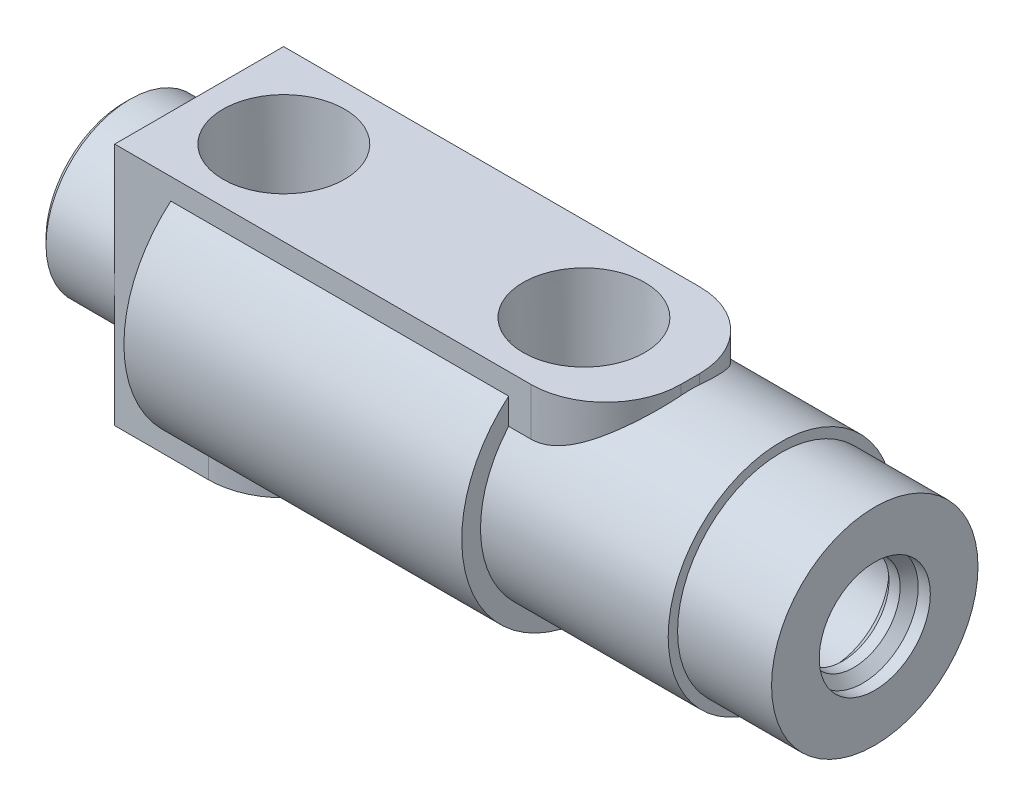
ISO-10303-21;
HEADER;
FILE_DESCRIPTION(('STEP AP214'),'2;1');
FILE_NAME('part.step','',(''),(''),'','','');
FILE_SCHEMA(('AUTOMOTIVE_DESIGN { 1 0 10303 214 1 1 1 1 }'));
ENDSEC;
DATA;
#1=APPLICATION_CONTEXT('core data for automotive mechanical design processes');
#2=APPLICATION_PROTOCOL_DEFINITION('international standard','automotive_design',2000,#1);
#3=PRODUCT_CONTEXT('',#1,'mechanical');
#4=PRODUCT('Part','Part','',(#3));
#5=PRODUCT_RELATED_PRODUCT_CATEGORY('part','',(#4));
#6=PRODUCT_DEFINITION_FORMATION('','',#4);
#7=PRODUCT_DEFINITION_CONTEXT('part definition',#1,'design');
#8=PRODUCT_DEFINITION('design','',#6,#7);
#9=PRODUCT_DEFINITION_SHAPE('','',#8);
#10=(LENGTH_UNIT() NAMED_UNIT(*) SI_UNIT(.MILLI.,.METRE.));
#11=(NAMED_UNIT(*) PLANE_ANGLE_UNIT() SI_UNIT($,.RADIAN.));
#12=(NAMED_UNIT(*) SI_UNIT($,.STERADIAN.) SOLID_ANGLE_UNIT());
#13=UNCERTAINTY_MEASURE_WITH_UNIT(LENGTH_MEASURE(1.E-05),#10,'distance_accuracy_value','');
#14=(GEOMETRIC_REPRESENTATION_CONTEXT(3) GLOBAL_UNCERTAINTY_ASSIGNED_CONTEXT((#13)) GLOBAL_UNIT_ASSIGNED_CONTEXT((#10,
#11,#12)) REPRESENTATION_CONTEXT('',''));
#15=CARTESIAN_POINT('',(0.,0.,0.));
#16=DIRECTION('',(0.,0.,1.));
#17=DIRECTION('',(1.,0.,0.));
#18=AXIS2_PLACEMENT_3D('',#15,#16,#17);
#19=CARTESIAN_POINT('',(-39.116,4.2164,0.));
#20=DIRECTION('',(1.,0.,0.));
#21=DIRECTION('',(0.,0.,-1.));
#22=AXIS2_PLACEMENT_3D('',#19,#20,#21);
#23=PLANE('',#22);
#24=CARTESIAN_POINT('',(-39.116,0.,0.));
#25=DIRECTION('',(-1.,0.,0.));
#26=DIRECTION('',(0.,0.,1.));
#27=AXIS2_PLACEMENT_3D('',#24,#25,#26);
#28=CIRCLE('',#27,4.21640000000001);
#29=CARTESIAN_POINT('',(-39.116,0.,4.21640000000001));
#30=VERTEX_POINT('',#29);
#31=EDGE_CURVE('E206',#30,#30,#28,.T.);
#32=ORIENTED_EDGE('',*,*,#31,.T.);
#33=EDGE_LOOP('',(#32));
#34=FACE_BOUND('',#33,.T.);
#35=CARTESIAN_POINT('',(-39.116,0.,0.));
#36=DIRECTION('',(-1.,0.,0.));
#37=DIRECTION('',(0.,0.,1.));
#38=AXIS2_PLACEMENT_3D('',#35,#36,#37);
#39=CIRCLE('',#38,3.9686738);
#40=CARTESIAN_POINT('',(-39.116,0.,3.9686738));
#41=VERTEX_POINT('',#40);
#42=EDGE_CURVE('E618',#41,#41,#39,.T.);
#43=ORIENTED_EDGE('',*,*,#42,.F.);
#44=EDGE_LOOP('',(#43));
#45=FACE_BOUND('',#44,.T.);
#46=ADVANCED_FACE('F34',(#34,#45),#23,.F.);
#47=CARTESIAN_POINT('',(-49.9872,2.38760000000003,0.));
#48=DIRECTION('',(0.,1.,0.));
#49=DIRECTION('',(0.,0.,1.));
#50=AXIS2_PLACEMENT_3D('',#47,#48,#49);
#51=PLANE('',#50);
#52=DIRECTION('',(-1.,0.,0.));
#53=VECTOR('',#52,1.);
#54=CARTESIAN_POINT('',(-63.5,2.38760000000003,-3.47525469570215));
#55=LINE('',#54,#53);
#56=CARTESIAN_POINT('',(-46.7812243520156,2.38760000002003,-3.47525469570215));
#57=VERTEX_POINT('',#56);
#58=CARTESIAN_POINT('',(-53.1931756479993,2.38760000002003,-3.47525469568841));
#59=VERTEX_POINT('',#58);
#60=EDGE_CURVE('E58',#57,#59,#55,.T.);
#61=ORIENTED_EDGE('',*,*,#60,.F.);
#62=CARTESIAN_POINT('',(-49.9872,2.38760000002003,0.));
#63=DIRECTION('',(0.,1.,0.));
#64=DIRECTION('',(0.,0.,1.));
#65=AXIS2_PLACEMENT_3D('',#62,#63,#64);
#66=CIRCLE('',#65,4.72817883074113);
#67=EDGE_CURVE('E210',#57,#59,#66,.T.);
#68=ORIENTED_EDGE('',*,*,#67,.T.);
#69=EDGE_LOOP('',(#61,#68));
#70=FACE_BOUND('',#69,.T.);
#71=ADVANCED_FACE('F565',(#70),#51,.T.);
#72=CARTESIAN_POINT('',(-49.9872,-2.38760000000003,0.));
#73=DIRECTION('',(0.,-1.,0.));
#74=DIRECTION('',(0.,0.,-1.));
#75=AXIS2_PLACEMENT_3D('',#72,#73,#74);
#76=PLANE('',#75);
#77=DIRECTION('',(-1.,0.,0.));
#78=VECTOR('',#77,1.);
#79=CARTESIAN_POINT('',(-63.5,-2.38760000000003,3.47525469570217));
#80=LINE('',#79,#78);
#81=CARTESIAN_POINT('',(-46.78122435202,-2.38760000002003,3.47525469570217));
#82=VERTEX_POINT('',#81);
#83=CARTESIAN_POINT('',(-53.1931756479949,-2.38760000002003,3.47525469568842));
#84=VERTEX_POINT('',#83);
#85=EDGE_CURVE('E50',#82,#84,#80,.T.);
#86=ORIENTED_EDGE('',*,*,#85,.F.);
#87=CARTESIAN_POINT('',(-49.9872,-2.38760000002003,0.));
#88=DIRECTION('',(0.,-1.,0.));
#89=DIRECTION('',(0.,0.,-1.));
#90=AXIS2_PLACEMENT_3D('',#87,#88,#89);
#91=CIRCLE('',#90,4.72817883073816);
#92=EDGE_CURVE('E211',#82,#84,#91,.T.);
#93=ORIENTED_EDGE('',*,*,#92,.T.);
#94=EDGE_LOOP('',(#86,#93));
#95=FACE_BOUND('',#94,.T.);
#96=ADVANCED_FACE('F455',(#95),#76,.T.);
#97=CARTESIAN_POINT('',(-2.73059137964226,0.,0.));
#98=DIRECTION('',(1.,0.,0.));
#99=DIRECTION('',(0.,0.,-1.));
#100=AXIS2_PLACEMENT_3D('',#97,#98,#99);
#101=CYLINDRICAL_SURFACE('',#100,3.93612552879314);
#102=CARTESIAN_POINT('',(-1.79006737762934,0.,0.));
#103=DIRECTION('',(1.,0.,0.));
#104=DIRECTION('',(0.,0.,-1.));
#105=AXIS2_PLACEMENT_3D('',#102,#103,#104);
#106=CIRCLE('',#105,3.93612552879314);
#107=CARTESIAN_POINT('',(-1.79006737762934,0.,-3.93612552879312));
#108=VERTEX_POINT('',#107);
#109=EDGE_CURVE('E261',#108,#108,#106,.T.);
#110=ORIENTED_EDGE('',*,*,#109,.T.);
#111=EDGE_LOOP('',(#110));
#112=FACE_BOUND('',#111,.T.);
#113=CARTESIAN_POINT('',(-2.73059137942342,0.,0.));
#114=DIRECTION('',(-1.,0.,0.));
#115=DIRECTION('',(0.,0.,1.));
#116=AXIS2_PLACEMENT_3D('',#113,#114,#115);
#117=CIRCLE('',#116,3.93612552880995);
#118=CARTESIAN_POINT('',(-2.73059137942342,0.,3.93612552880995));
#119=VERTEX_POINT('',#118);
#120=EDGE_CURVE('E258',#119,#119,#117,.T.);
#121=ORIENTED_EDGE('',*,*,#120,.T.);
#122=EDGE_LOOP('',(#121));
#123=FACE_BOUND('',#122,.T.);
#124=ADVANCED_FACE('F595',(#112,#123),#101,.F.);
#125=CARTESIAN_POINT('',(-3.49346585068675,0.,0.));
#126=DIRECTION('',(-1.,0.,0.));
#127=DIRECTION('',(0.,0.,1.));
#128=AXIS2_PLACEMENT_3D('',#125,#126,#127);
#129=CONICAL_SURFACE('',#128,4.69900000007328,0.785398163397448);
#130=CARTESIAN_POINT('',(-3.49346585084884,0.,0.));
#131=DIRECTION('',(1.,0.,0.));
#132=DIRECTION('',(0.,0.,-1.));
#133=AXIS2_PLACEMENT_3D('',#130,#131,#132);
#134=CIRCLE('',#133,4.699);
#135=CARTESIAN_POINT('',(-3.49346585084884,0.,-4.699));
#136=VERTEX_POINT('',#135);
#137=EDGE_CURVE('E263',#136,#136,#134,.F.);
#138=ORIENTED_EDGE('',*,*,#137,.T.);
#139=EDGE_LOOP('',(#138));
#140=FACE_BOUND('',#139,.T.);
#141=ORIENTED_EDGE('',*,*,#120,.F.);
#142=EDGE_LOOP('',(#141));
#143=FACE_BOUND('',#142,.T.);
#144=ADVANCED_FACE('F589',(#140,#143),#129,.F.);
#145=CARTESIAN_POINT('',(-1.02719290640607,0.,0.));
#146=DIRECTION('',(1.,0.,0.));
#147=DIRECTION('',(0.,1.,0.));
#148=AXIS2_PLACEMENT_3D('',#145,#146,#147);
#149=CONICAL_SURFACE('',#148,4.69899999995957,0.785398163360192);
#150=ORIENTED_EDGE('',*,*,#109,.F.);
#151=EDGE_LOOP('',(#150));
#152=FACE_BOUND('',#151,.T.);
#153=CARTESIAN_POINT('',(-1.02719290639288,0.,0.));
#154=DIRECTION('',(1.,0.,0.));
#155=DIRECTION('',(0.,0.,-1.));
#156=AXIS2_PLACEMENT_3D('',#153,#154,#155);
#157=CIRCLE('',#156,4.69899999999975);
#158=CARTESIAN_POINT('',(-1.02719290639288,0.,-4.69899999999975));
#159=VERTEX_POINT('',#158);
#160=EDGE_CURVE('E266',#159,#159,#157,.T.);
#161=ORIENTED_EDGE('',*,*,#160,.T.);
#162=EDGE_LOOP('',(#161));
#163=FACE_BOUND('',#162,.T.);
#164=ADVANCED_FACE('F586',(#152,#163),#149,.F.);
#165=CARTESIAN_POINT('',(-9.39881195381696,0.,0.));
#166=DIRECTION('',(1.,0.,0.));
#167=DIRECTION('',(0.,0.,-1.));
#168=AXIS2_PLACEMENT_3D('',#165,#166,#167);
#169=CYLINDRICAL_SURFACE('',#168,4.699);
#170=ORIENTED_EDGE('',*,*,#137,.F.);
#171=EDGE_LOOP('',(#170));
#172=FACE_BOUND('',#171,.T.);
#173=CARTESIAN_POINT('',(-9.39881195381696,0.,0.));
#174=DIRECTION('',(1.,0.,0.));
#175=DIRECTION('',(0.,0.,-1.));
#176=AXIS2_PLACEMENT_3D('',#173,#174,#175);
#177=CIRCLE('',#176,4.699);
#178=CARTESIAN_POINT('',(-9.39881195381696,0.,-4.699));
#179=VERTEX_POINT('',#178);
#180=EDGE_CURVE('E251',#179,#179,#177,.F.);
#181=ORIENTED_EDGE('',*,*,#180,.T.);
#182=EDGE_LOOP('',(#181));
#183=FACE_BOUND('',#182,.T.);
#184=ADVANCED_FACE('F584',(#172,#183),#169,.F.);
#185=CARTESIAN_POINT('',(-1.02719290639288,0.,0.));
#186=DIRECTION('',(1.,0.,0.));
#187=DIRECTION('',(0.,0.,-1.));
#188=AXIS2_PLACEMENT_3D('',#185,#186,#187);
#189=CYLINDRICAL_SURFACE('',#188,4.69899999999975);
#190=ORIENTED_EDGE('',*,*,#160,.F.);
#191=EDGE_LOOP('',(#190));
#192=FACE_BOUND('',#191,.T.);
#193=CARTESIAN_POINT('',(0.,0.,0.));
#194=DIRECTION('',(1.,0.,0.));
#195=DIRECTION('',(0.,0.,-1.));
#196=AXIS2_PLACEMENT_3D('',#193,#194,#195);
#197=CIRCLE('',#196,4.69899999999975);
#198=CARTESIAN_POINT('',(0.,0.,-4.69899999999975));
#199=VERTEX_POINT('',#198);
#200=EDGE_CURVE('E248',#199,#199,#197,.F.);
#201=ORIENTED_EDGE('',*,*,#200,.F.);
#202=EDGE_LOOP('',(#201));
#203=FACE_BOUND('',#202,.T.);
#204=ADVANCED_FACE('F580',(#192,#203),#189,.F.);
#205=CARTESIAN_POINT('',(-24.5999,0.,0.));
#206=DIRECTION('',(0.,1.,0.));
#207=DIRECTION('',(0.,0.,1.));
#208=AXIS2_PLACEMENT_3D('',#205,#206,#207);
#209=CYLINDRICAL_SURFACE('',#208,3.1496);
#210=CARTESIAN_POINT('',(-24.5999,0.,0.));
#211=DIRECTION('',(-0.707106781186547,0.707106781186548,0.));
#212=DIRECTION('',(0.707106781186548,0.707106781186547,0.));
#213=AXIS2_PLACEMENT_3D('',#210,#211,#212);
#214=ELLIPSE('',#213,4.45420703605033,3.1496);
#215=CARTESIAN_POINT('',(-22.4663000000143,2.13359999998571,2.31683646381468));
#216=VERTEX_POINT('',#215);
#217=CARTESIAN_POINT('',(-24.5999,0.,3.1496));
#218=VERTEX_POINT('',#217);
#219=EDGE_CURVE('E234',#216,#218,#214,.F.);
#220=ORIENTED_EDGE('',*,*,#219,.T.);
#221=CARTESIAN_POINT('',(-24.5999,0.,0.));
#222=DIRECTION('',(0.707106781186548,0.707106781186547,0.));
#223=DIRECTION('',(-0.707106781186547,0.707106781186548,0.));
#224=AXIS2_PLACEMENT_3D('',#221,#222,#223);
#225=ELLIPSE('',#224,4.45420703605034,3.1496);
#226=CARTESIAN_POINT('',(-26.7334999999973,2.13359999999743,2.31683646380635));
#227=VERTEX_POINT('',#226);
#228=EDGE_CURVE('E245',#218,#227,#225,.F.);
#229=ORIENTED_EDGE('',*,*,#228,.T.);
#230=CARTESIAN_POINT('',(-24.5999,2.13359999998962,0.));
#231=DIRECTION('',(0.,1.,0.));
#232=DIRECTION('',(0.,0.,1.));
#233=AXIS2_PLACEMENT_3D('',#230,#231,#232);
#234=CIRCLE('',#233,3.1496);
#235=EDGE_CURVE('E241',#227,#216,#234,.T.);
#236=ORIENTED_EDGE('',*,*,#235,.T.);
#237=EDGE_LOOP('',(#220,#229,#236));
#238=FACE_BOUND('',#237,.T.);
#239=ADVANCED_FACE('F577',(#238),#209,.F.);
#240=CARTESIAN_POINT('',(-9.39881195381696,-4.699,-4.699));
#241=DIRECTION('',(-1.,0.,0.));
#242=DIRECTION('',(0.,0.,1.));
#243=AXIS2_PLACEMENT_3D('',#240,#241,#242);
#244=PLANE('',#243);
#245=CARTESIAN_POINT('',(-9.39881195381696,0.,0.));
#246=DIRECTION('',(-1.,0.,0.));
#247=DIRECTION('',(0.,0.,1.));
#248=AXIS2_PLACEMENT_3D('',#245,#246,#247);
#249=CIRCLE('',#248,3.14960000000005);
#250=CARTESIAN_POINT('',(-9.39881195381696,0.,3.14960000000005));
#251=VERTEX_POINT('',#250);
#252=EDGE_CURVE('E236',#251,#251,#249,.T.);
#253=ORIENTED_EDGE('',*,*,#252,.T.);
#254=EDGE_LOOP('',(#253));
#255=FACE_BOUND('',#254,.T.);
#256=ORIENTED_EDGE('',*,*,#180,.F.);
#257=EDGE_LOOP('',(#256));
#258=FACE_BOUND('',#257,.T.);
#259=ADVANCED_FACE('F36',(#255,#258),#244,.F.);
#260=CARTESIAN_POINT('',(-24.5999,0.,0.));
#261=DIRECTION('',(0.,1.,0.));
#262=DIRECTION('',(0.,0.,1.));
#263=AXIS2_PLACEMENT_3D('',#260,#261,#262);
#264=CYLINDRICAL_SURFACE('',#263,3.1496);
#265=CARTESIAN_POINT('',(-24.5999,0.,0.));
#266=DIRECTION('',(0.707106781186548,0.707106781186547,0.));
#267=DIRECTION('',(-0.707106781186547,0.707106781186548,0.));
#268=AXIS2_PLACEMENT_3D('',#265,#266,#267);
#269=ELLIPSE('',#268,4.45420703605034,3.1496);
#270=CARTESIAN_POINT('',(-26.7335,2.13360000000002,-2.31683646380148));
#271=VERTEX_POINT('',#270);
#272=CARTESIAN_POINT('',(-24.5999,0.,-3.14960000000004));
#273=VERTEX_POINT('',#272);
#274=EDGE_CURVE('E243',#271,#273,#269,.F.);
#275=ORIENTED_EDGE('',*,*,#274,.T.);
#276=CARTESIAN_POINT('',(-24.5999,0.,0.));
#277=DIRECTION('',(-0.707106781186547,0.707106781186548,0.));
#278=DIRECTION('',(0.707106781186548,0.707106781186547,0.));
#279=AXIS2_PLACEMENT_3D('',#276,#277,#278);
#280=ELLIPSE('',#279,4.45420703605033,3.1496);
#281=CARTESIAN_POINT('',(-22.4663000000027,2.13360000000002,-2.31683646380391));
#282=VERTEX_POINT('',#281);
#283=EDGE_CURVE('E238',#273,#282,#280,.F.);
#284=ORIENTED_EDGE('',*,*,#283,.T.);
#285=CARTESIAN_POINT('',(-24.5999,2.13360000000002,0.));
#286=DIRECTION('',(0.,1.,0.));
#287=DIRECTION('',(0.,0.,1.));
#288=AXIS2_PLACEMENT_3D('',#285,#286,#287);
#289=CIRCLE('',#288,3.1496);
#290=EDGE_CURVE('E231',#282,#271,#289,.T.);
#291=ORIENTED_EDGE('',*,*,#290,.T.);
#292=EDGE_LOOP('',(#275,#284,#291));
#293=FACE_BOUND('',#292,.T.);
#294=ADVANCED_FACE('F572',(#293),#264,.F.);
#295=CARTESIAN_POINT('',(0.,4.365625,0.));
#296=DIRECTION('',(1.,0.,0.));
#297=DIRECTION('',(0.,0.,-1.));
#298=AXIS2_PLACEMENT_3D('',#295,#296,#297);
#299=PLANE('',#298);
#300=CARTESIAN_POINT('',(0.,0.,0.));
#301=DIRECTION('',(1.,0.,0.));
#302=DIRECTION('',(0.,0.,-1.));
#303=AXIS2_PLACEMENT_3D('',#300,#301,#302);
#304=CIRCLE('',#303,8.73125);
#305=CARTESIAN_POINT('',(0.,0.,-8.73125));
#306=VERTEX_POINT('',#305);
#307=EDGE_CURVE('E227',#306,#306,#304,.F.);
#308=ORIENTED_EDGE('',*,*,#307,.F.);
#309=EDGE_LOOP('',(#308));
#310=FACE_BOUND('',#309,.T.);
#311=ORIENTED_EDGE('',*,*,#200,.T.);
#312=EDGE_LOOP('',(#311));
#313=FACE_BOUND('',#312,.T.);
#314=ADVANCED_FACE('F568',(#310,#313),#299,.T.);
#315=DIRECTION('',(-1.,0.,0.));
#316=VECTOR('',#315,1.);
#317=CARTESIAN_POINT('',(-63.5,-2.38760000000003,-3.47525469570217));
#318=LINE('',#317,#316);
#319=CARTESIAN_POINT('',(-53.1931756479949,-2.38760000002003,-3.47525469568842));
#320=VERTEX_POINT('',#319);
#321=CARTESIAN_POINT('',(-46.78122435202,-2.38760000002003,-3.47525469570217));
#322=VERTEX_POINT('',#321);
#323=EDGE_CURVE('E305',#320,#322,#318,.F.);
#324=ORIENTED_EDGE('',*,*,#323,.F.);
#325=EDGE_CURVE('E215',#320,#322,#91,.T.);
#326=ORIENTED_EDGE('',*,*,#325,.T.);
#327=EDGE_LOOP('',(#324,#326));
#328=FACE_BOUND('',#327,.T.);
#329=ADVANCED_FACE('F564',(#328),#76,.T.);
#330=DIRECTION('',(-1.,0.,0.));
#331=VECTOR('',#330,1.);
#332=CARTESIAN_POINT('',(-63.5,2.38760000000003,3.47525469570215));
#333=LINE('',#332,#331);
#334=CARTESIAN_POINT('',(-53.1931756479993,2.38760000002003,3.47525469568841));
#335=VERTEX_POINT('',#334);
#336=CARTESIAN_POINT('',(-46.7812243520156,2.38760000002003,3.47525469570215));
#337=VERTEX_POINT('',#336);
#338=EDGE_CURVE('E195',#335,#337,#333,.F.);
#339=ORIENTED_EDGE('',*,*,#338,.F.);
#340=EDGE_CURVE('E205',#335,#337,#66,.T.);
#341=ORIENTED_EDGE('',*,*,#340,.T.);
#342=EDGE_LOOP('',(#339,#341));
#343=FACE_BOUND('',#342,.T.);
#344=ADVANCED_FACE('F204',(#343),#51,.T.);
#345=CARTESIAN_POINT('',(-20.4935339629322,2.13360000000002,2.31683646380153));
#346=DIRECTION('',(0.,-1.,0.));
#347=DIRECTION('',(0.,0.,-1.));
#348=AXIS2_PLACEMENT_3D('',#345,#346,#347);
#349=PLANE('',#348);
#350=DIRECTION('',(1.,0.,0.));
#351=VECTOR('',#350,1.);
#352=CARTESIAN_POINT('',(-20.4935339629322,2.13360000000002,2.31683646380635));
#353=LINE('',#352,#351);
#354=CARTESIAN_POINT('',(-28.7062660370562,2.13359999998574,2.31683646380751));
#355=VERTEX_POINT('',#354);
#356=EDGE_CURVE('E240',#355,#227,#353,.T.);
#357=ORIENTED_EDGE('',*,*,#356,.F.);
#358=CARTESIAN_POINT('',(-24.5999,2.13359999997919,0.));
#359=DIRECTION('',(0.,1.,0.));
#360=DIRECTION('',(0.,0.,1.));
#361=AXIS2_PLACEMENT_3D('',#358,#359,#360);
#362=CIRCLE('',#361,4.71486725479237);
#363=CARTESIAN_POINT('',(-20.4935339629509,2.1335999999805,2.3168364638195));
#364=VERTEX_POINT('',#363);
#365=EDGE_CURVE('E549',#355,#364,#362,.T.);
#366=ORIENTED_EDGE('',*,*,#365,.T.);
#367=DIRECTION('',(-1.,0.,0.));
#368=VECTOR('',#367,1.);
#369=CARTESIAN_POINT('',(-11.341911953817,2.13359999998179,2.3168364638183));
#370=LINE('',#369,#368);
#371=EDGE_CURVE('E237',#364,#216,#370,.T.);
#372=ORIENTED_EDGE('',*,*,#371,.T.);
#373=ORIENTED_EDGE('',*,*,#235,.F.);
#374=EDGE_LOOP('',(#357,#366,#372,#373));
#375=FACE_BOUND('',#374,.T.);
#376=ADVANCED_FACE('F556',(#375),#349,.F.);
#377=CARTESIAN_POINT('',(-11.341911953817,0.,0.));
#378=DIRECTION('',(-1.,0.,0.));
#379=DIRECTION('',(0.,0.,1.));
#380=AXIS2_PLACEMENT_3D('',#377,#378,#379);
#381=CYLINDRICAL_SURFACE('',#380,3.14960000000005);
#382=CARTESIAN_POINT('',(-32.2326,0.,0.));
#383=DIRECTION('',(1.,0.,0.));
#384=DIRECTION('',(0.,0.,-1.));
#385=AXIS2_PLACEMENT_3D('',#382,#383,#384);
#386=CIRCLE('',#385,3.14960000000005);
#387=CARTESIAN_POINT('',(-32.2326,0.,-3.14960000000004));
#388=VERTEX_POINT('',#387);
#389=EDGE_CURVE('E38',#388,#388,#386,.F.);
#390=ORIENTED_EDGE('',*,*,#389,.T.);
#391=EDGE_LOOP('',(#390));
#392=FACE_BOUND('',#391,.T.);
#393=ORIENTED_EDGE('',*,*,#228,.F.);
#394=ORIENTED_EDGE('',*,*,#219,.F.);
#395=ORIENTED_EDGE('',*,*,#371,.F.);
#396=CARTESIAN_POINT('',(-20.4935339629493,2.13359999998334,2.3168364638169));
#397=CARTESIAN_POINT('',(-20.4574578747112,2.19580937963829,2.25952211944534));
#398=CARTESIAN_POINT('',(-20.4217420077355,2.25580665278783,2.19965802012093));
#399=CARTESIAN_POINT('',(-20.3516236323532,2.37116592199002,2.07480633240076));
#400=CARTESIAN_POINT('',(-20.317222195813,2.42652417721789,2.00981468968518));
#401=CARTESIAN_POINT('',(-20.216420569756,2.58604341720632,1.80615255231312));
#402=CARTESIAN_POINT('',(-20.1530337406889,2.68262223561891,1.65973238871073));
#403=CARTESIAN_POINT('',(-20.0680172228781,2.80956266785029,1.42628158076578));
#404=CARTESIAN_POINT('',(-20.0412828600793,2.84899029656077,1.34586699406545));
#405=CARTESIAN_POINT('',(-19.9918955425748,2.92121186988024,1.18092694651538));
#406=CARTESIAN_POINT('',(-19.9692400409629,2.95400995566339,1.09640409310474));
#407=CARTESIAN_POINT('',(-19.9286999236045,3.01233656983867,0.92414777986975));
#408=CARTESIAN_POINT('',(-19.9107977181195,3.0378919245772,0.836427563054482));
#409=CARTESIAN_POINT('',(-19.8801836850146,3.08141239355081,0.658241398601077));
#410=CARTESIAN_POINT('',(-19.8674707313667,3.0993791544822,0.567776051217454));
#411=CARTESIAN_POINT('',(-19.8490047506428,3.12541750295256,0.397619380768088));
#412=CARTESIAN_POINT('',(-19.8425341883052,3.13451127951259,0.318160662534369));
#413=CARTESIAN_POINT('',(-19.8339075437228,3.14662701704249,0.158517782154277));
#414=CARTESIAN_POINT('',(-19.8317528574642,3.14964701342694,0.0783333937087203));
#415=CARTESIAN_POINT('',(-19.8318207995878,3.14955190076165,-0.0820319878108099));
#416=CARTESIAN_POINT('',(-19.834043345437,3.14643690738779,-0.162212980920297));
#417=CARTESIAN_POINT('',(-19.8428021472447,3.13413431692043,-0.321879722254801));
#418=CARTESIAN_POINT('',(-19.8493400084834,3.1249444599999,-0.401365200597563));
#419=CARTESIAN_POINT('',(-19.873552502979,3.09080388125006,-0.622588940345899));
#420=CARTESIAN_POINT('',(-19.8959563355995,3.05911966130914,-0.762845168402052));
#421=CARTESIAN_POINT('',(-19.9526926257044,2.97794472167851,-1.03542463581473));
#422=CARTESIAN_POINT('',(-19.987026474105,2.92845192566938,-1.16774694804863));
#423=CARTESIAN_POINT('',(-20.0681700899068,2.80950882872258,-1.43145090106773));
#424=CARTESIAN_POINT('',(-20.1157033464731,2.7388726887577,-1.56207029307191));
#425=CARTESIAN_POINT('',(-20.2187757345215,2.58180879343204,-1.80991268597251));
#426=CARTESIAN_POINT('',(-20.27431543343,2.49537991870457,-1.92713473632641));
#427=CARTESIAN_POINT('',(-20.3583685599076,2.36001132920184,-2.08675974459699));
#428=CARTESIAN_POINT('',(-20.3849894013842,2.31652339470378,-2.1349229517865));
#429=CARTESIAN_POINT('',(-20.4388514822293,2.22697926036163,-2.22816131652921));
#430=CARTESIAN_POINT('',(-20.4660909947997,2.18092978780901,-2.27324392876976));
#431=CARTESIAN_POINT('',(-20.4935339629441,2.13359999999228,-2.31683646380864));
#432=B_SPLINE_CURVE_WITH_KNOTS('',3,(#396,#397,#398,#399,#400,#401,#402,#403,#404,#405,#406,
#407,#408,#409,#410,#411,#412,#413,#414,#415,#416,#417,#418,#419,#420,#421,#422,#423,#424,#425,
#426,#427,#428,#429,#430,#431),.UNSPECIFIED.,.F.,.F.,(4,2,2,2,2,2,2,2,2,2,2,2,2,2,2,2,2,4),(0.,
0.275705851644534,0.551631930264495,1.107993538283,1.38806604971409,1.66796306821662,
1.94680940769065,2.22559520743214,2.46597548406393,2.7064335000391,2.94688698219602,
3.18742996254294,3.62192777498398,4.05647626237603,4.52249778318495,4.98855234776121,
5.19887631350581,5.40867184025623),.UNSPECIFIED.);
#433=CARTESIAN_POINT('',(-20.4935339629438,2.13359999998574,-2.31683646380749));
#434=VERTEX_POINT('',#433);
#435=EDGE_CURVE('E542',#364,#434,#432,.T.);
#436=ORIENTED_EDGE('',*,*,#435,.T.);
#437=DIRECTION('',(1.,0.,0.));
#438=VECTOR('',#437,1.);
#439=CARTESIAN_POINT('',(-20.4935339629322,2.13360000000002,-2.31683646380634));
#440=LINE('',#439,#438);
#441=EDGE_CURVE('E233',#434,#282,#440,.F.);
#442=ORIENTED_EDGE('',*,*,#441,.T.);
#443=ORIENTED_EDGE('',*,*,#283,.F.);
#444=ORIENTED_EDGE('',*,*,#274,.F.);
#445=DIRECTION('',(1.,0.,0.));
#446=VECTOR('',#445,1.);
#447=CARTESIAN_POINT('',(-20.4935339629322,2.13360000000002,-2.31683646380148));
#448=LINE('',#447,#446);
#449=CARTESIAN_POINT('',(-28.7062660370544,2.13359999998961,-2.31683646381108));
#450=VERTEX_POINT('',#449);
#451=EDGE_CURVE('E230',#271,#450,#448,.F.);
#452=ORIENTED_EDGE('',*,*,#451,.T.);
#453=CARTESIAN_POINT('',(-28.7062660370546,2.13359999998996,-2.31683646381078));
#454=CARTESIAN_POINT('',(-28.7423421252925,2.19580937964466,-2.25952211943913));
#455=CARTESIAN_POINT('',(-28.7780579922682,2.25580665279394,-2.19965802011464));
#456=CARTESIAN_POINT('',(-28.8481763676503,2.37116592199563,-2.07480633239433));
#457=CARTESIAN_POINT('',(-28.8825778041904,2.42652417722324,-2.0098146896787));
#458=CARTESIAN_POINT('',(-28.983379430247,2.58604341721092,-1.8061525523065));
#459=CARTESIAN_POINT('',(-29.0467662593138,2.68262223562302,-1.65973238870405));
#460=CARTESIAN_POINT('',(-29.1317827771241,2.80956266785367,-1.42628158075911));
#461=CARTESIAN_POINT('',(-29.1585171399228,2.84899029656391,-1.34586699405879));
#462=CARTESIAN_POINT('',(-29.207904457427,2.9212118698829,-1.18092694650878));
#463=CARTESIAN_POINT('',(-29.2305599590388,2.95400995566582,-1.09640409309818));
#464=CARTESIAN_POINT('',(-29.2711000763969,3.01233656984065,-0.924147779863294));
#465=CARTESIAN_POINT('',(-29.2890022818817,3.03789192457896,-0.836427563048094));
#466=CARTESIAN_POINT('',(-29.3196163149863,3.08141239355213,-0.658241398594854));
#467=CARTESIAN_POINT('',(-29.3323292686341,3.09937915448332,-0.567776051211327));
#468=CARTESIAN_POINT('',(-29.3507952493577,3.12541750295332,-0.397619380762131));
#469=CARTESIAN_POINT('',(-29.3572658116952,3.13451127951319,-0.318160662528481));
#470=CARTESIAN_POINT('',(-29.3658924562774,3.14662701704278,-0.158517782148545));
#471=CARTESIAN_POINT('',(-29.3680471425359,3.14964701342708,-0.0783333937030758));
#472=CARTESIAN_POINT('',(-29.3679792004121,3.14955190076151,0.0820319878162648));
#473=CARTESIAN_POINT('',(-29.3657566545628,3.14643690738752,0.162212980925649));
#474=CARTESIAN_POINT('',(-29.3569978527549,3.1341343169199,0.321879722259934));
#475=CARTESIAN_POINT('',(-29.3504599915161,3.12494445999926,0.40136520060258));
#476=CARTESIAN_POINT('',(-29.3262474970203,3.09080388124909,0.622588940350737));
#477=CARTESIAN_POINT('',(-29.3038436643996,3.05911966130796,0.762845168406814));
#478=CARTESIAN_POINT('',(-29.2471073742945,2.97794472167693,1.0354246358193));
#479=CARTESIAN_POINT('',(-29.2127735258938,2.92845192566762,1.16774694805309));
#480=CARTESIAN_POINT('',(-29.1316299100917,2.8095088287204,1.43145090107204));
#481=CARTESIAN_POINT('',(-29.0840966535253,2.73887268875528,1.56207029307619));
#482=CARTESIAN_POINT('',(-28.9810242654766,2.58180879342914,1.80991268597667));
#483=CARTESIAN_POINT('',(-28.925484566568,2.49537991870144,1.92713473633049));
#484=CARTESIAN_POINT('',(-28.8414314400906,2.36001132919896,2.08675974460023));
#485=CARTESIAN_POINT('',(-28.8148105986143,2.31652339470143,2.13492295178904));
#486=CARTESIAN_POINT('',(-28.76094851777,2.22697926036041,2.22816131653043));
#487=CARTESIAN_POINT('',(-28.7337090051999,2.18092978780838,2.27324392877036));
#488=CARTESIAN_POINT('',(-28.706266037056,2.13359999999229,2.31683646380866));
#489=B_SPLINE_CURVE_WITH_KNOTS('',3,(#453,#454,#455,#456,#457,#458,#459,#460,#461,#462,#463,
#464,#465,#466,#467,#468,#469,#470,#471,#472,#473,#474,#475,#476,#477,#478,#479,#480,#481,#482,
#483,#484,#485,#486,#487,#488),.UNSPECIFIED.,.F.,.F.,(4,2,2,2,2,2,2,2,2,2,2,2,2,2,2,2,2,4),(0.,
0.275705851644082,0.551631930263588,1.10799353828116,1.38806604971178,1.66796306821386,
1.94680940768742,2.22559520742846,2.46597548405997,2.70643350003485,2.94688698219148,
3.18742996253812,3.62192777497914,4.05647626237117,4.52249778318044,4.98855234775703,
5.19887631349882,5.40867184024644),.UNSPECIFIED.);
#490=EDGE_CURVE('E213',#450,#355,#489,.T.);
#491=ORIENTED_EDGE('',*,*,#490,.T.);
#492=ORIENTED_EDGE('',*,*,#356,.T.);
#493=EDGE_LOOP('',(#393,#394,#395,#436,#442,#443,#444,#452,#491,#492));
#494=FACE_BOUND('',#493,.T.);
#495=ORIENTED_EDGE('',*,*,#252,.F.);
#496=EDGE_LOOP('',(#495));
#497=FACE_BOUND('',#496,.T.);
#498=ADVANCED_FACE('F551',(#392,#494,#497),#381,.F.);
#499=CARTESIAN_POINT('',(-20.4935339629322,2.13360000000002,-4.73884756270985));
#500=DIRECTION('',(0.,-1.,0.));
#501=DIRECTION('',(0.,0.,-1.));
#502=AXIS2_PLACEMENT_3D('',#499,#500,#501);
#503=PLANE('',#502);
#504=CARTESIAN_POINT('',(-24.5999,2.13359999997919,0.));
#505=DIRECTION('',(0.,1.,0.));
#506=DIRECTION('',(0.,0.,1.));
#507=AXIS2_PLACEMENT_3D('',#504,#505,#506);
#508=CIRCLE('',#507,4.71486725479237);
#509=EDGE_CURVE('E548',#434,#450,#508,.T.);
#510=ORIENTED_EDGE('',*,*,#509,.T.);
#511=ORIENTED_EDGE('',*,*,#451,.F.);
#512=ORIENTED_EDGE('',*,*,#290,.F.);
#513=ORIENTED_EDGE('',*,*,#441,.F.);
#514=EDGE_LOOP('',(#510,#511,#512,#513));
#515=FACE_BOUND('',#514,.T.);
#516=ADVANCED_FACE('F555',(#515),#503,.F.);
#517=CARTESIAN_POINT('',(-4.7244,0.,0.));
#518=DIRECTION('',(1.,0.,0.));
#519=DIRECTION('',(0.,0.,-1.));
#520=AXIS2_PLACEMENT_3D('',#517,#518,#519);
#521=CYLINDRICAL_SURFACE('',#520,8.73125);
#522=ORIENTED_EDGE('',*,*,#307,.T.);
#523=EDGE_LOOP('',(#522));
#524=FACE_BOUND('',#523,.T.);
#525=CARTESIAN_POINT('',(-7.9502,0.,0.));
#526=DIRECTION('',(1.,0.,0.));
#527=DIRECTION('',(0.,0.,-1.));
#528=AXIS2_PLACEMENT_3D('',#525,#526,#527);
#529=CIRCLE('',#528,8.73125);
#530=CARTESIAN_POINT('',(-7.9502,0.,-8.73125));
#531=VERTEX_POINT('',#530);
#532=EDGE_CURVE('E416',#531,#531,#529,.F.);
#533=ORIENTED_EDGE('',*,*,#532,.F.);
#534=EDGE_LOOP('',(#533));
#535=FACE_BOUND('',#534,.T.);
#536=ADVANCED_FACE('F311',(#524,#535),#521,.T.);
#537=CARTESIAN_POINT('',(-49.9872,-10.3123999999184,0.));
#538=DIRECTION('',(0.,-1.,0.));
#539=DIRECTION('',(0.,0.,-1.));
#540=AXIS2_PLACEMENT_3D('',#537,#538,#539);
#541=CONICAL_SURFACE('',#540,5.14349999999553,0.052359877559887);
#542=ORIENTED_EDGE('',*,*,#92,.F.);
#543=CARTESIAN_POINT('',(-46.7813887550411,-2.38740000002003,3.47539209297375));
#544=CARTESIAN_POINT('',(-46.7005092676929,-2.48573936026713,3.4078041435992));
#545=CARTESIAN_POINT('',(-46.6202495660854,-2.58163306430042,3.33581618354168));
#546=CARTESIAN_POINT('',(-46.4619837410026,-2.7682167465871,3.18271303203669));
#547=CARTESIAN_POINT('',(-46.3839817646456,-2.85889741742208,3.10158223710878));
#548=CARTESIAN_POINT('',(-46.2307558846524,-3.03529392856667,2.92922411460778));
#549=CARTESIAN_POINT('',(-46.1555684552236,-3.12094965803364,2.83790219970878));
#550=CARTESIAN_POINT('',(-46.010133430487,-3.28538595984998,2.64579908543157));
#551=CARTESIAN_POINT('',(-45.9398822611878,-3.36417151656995,2.54502485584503));
#552=CARTESIAN_POINT('',(-45.7729071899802,-3.55036848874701,2.28252093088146));
#553=CARTESIAN_POINT('',(-45.6799058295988,-3.65308869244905,2.11496514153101));
#554=CARTESIAN_POINT('',(-45.5129260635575,-3.83654684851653,1.76027376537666));
#555=CARTESIAN_POINT('',(-45.4388730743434,-3.91737106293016,1.5732191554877));
#556=CARTESIAN_POINT('',(-45.3240591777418,-4.04229954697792,1.21187387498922));
#557=CARTESIAN_POINT('',(-45.2799540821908,-4.09011192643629,1.03994327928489));
#558=CARTESIAN_POINT('',(-45.2118280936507,-4.16386564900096,0.687473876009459));
#559=CARTESIAN_POINT('',(-45.1878076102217,-4.18980654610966,0.506934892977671));
#560=CARTESIAN_POINT('',(-45.161702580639,-4.2179956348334,0.141893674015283));
#561=CARTESIAN_POINT('',(-45.1596793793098,-4.22017756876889,-0.0426182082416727));
#562=CARTESIAN_POINT('',(-45.1778978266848,-4.20050881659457,-0.409218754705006));
#563=CARTESIAN_POINT('',(-45.1981401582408,-4.1786573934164,-0.591307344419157));
#564=CARTESIAN_POINT('',(-45.2578616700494,-4.1140432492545,-0.939475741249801));
#565=CARTESIAN_POINT('',(-45.2964165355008,-4.07228497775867,-1.10590676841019));
#566=CARTESIAN_POINT('',(-45.3898649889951,-3.97073991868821,-1.42823339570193));
#567=CARTESIAN_POINT('',(-45.4447615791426,-3.91094981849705,-1.58412705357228));
#568=CARTESIAN_POINT('',(-45.5916702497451,-3.75021469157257,-1.9404412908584));
#569=CARTESIAN_POINT('',(-45.6898522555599,-3.64227091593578,-2.13516194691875));
#570=CARTESIAN_POINT('',(-45.9051351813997,-3.40326107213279,-2.4986913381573));
#571=CARTESIAN_POINT('',(-46.0222968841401,-3.2721205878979,-2.66741330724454));
#572=CARTESIAN_POINT('',(-46.2458459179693,-3.01818427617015,-2.94914596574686));
#573=CARTESIAN_POINT('',(-46.3501167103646,-2.89845610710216,-3.06666679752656));
#574=CARTESIAN_POINT('',(-46.5100075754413,-2.71170456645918,-3.22977538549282));
#575=CARTESIAN_POINT('',(-46.5636753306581,-2.64851378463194,-3.28177691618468));
#576=CARTESIAN_POINT('',(-46.6719280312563,-2.51973468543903,-3.38165490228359));
#577=CARTESIAN_POINT('',(-46.7265127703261,-2.45414690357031,-3.42953227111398));
#578=CARTESIAN_POINT('',(-46.7813887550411,-2.38740000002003,-3.47539209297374));
#579=B_SPLINE_CURVE_WITH_KNOTS('',3,(#543,#544,#545,#546,#547,#548,#549,#550,#551,#552,#553,
#554,#555,#556,#557,#558,#559,#560,#561,#562,#563,#564,#565,#566,#567,#568,#569,#570,#571,#572,
#573,#574,#575,#576,#577,#578),.UNSPECIFIED.,.F.,.F.,(4,2,2,2,2,2,2,2,2,2,2,2,2,2,2,2,2,4),(0.,
0.43243997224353,0.865629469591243,1.30323973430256,1.74052982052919,2.39029314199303,
3.03745812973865,3.58657043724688,4.1356939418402,4.68634842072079,5.23701978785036,
5.76244936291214,6.28797552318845,7.01397459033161,7.74234639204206,8.33375896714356,
8.62724811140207,8.92067208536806),.UNSPECIFIED.);
#580=EDGE_CURVE('E315',#82,#322,#579,.T.);
#581=ORIENTED_EDGE('',*,*,#580,.T.);
#582=ORIENTED_EDGE('',*,*,#325,.F.);
#583=CARTESIAN_POINT('',(-53.1930112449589,-2.38740000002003,-3.47539209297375));
#584=CARTESIAN_POINT('',(-53.2738907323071,-2.48573936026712,-3.4078041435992));
#585=CARTESIAN_POINT('',(-53.3541504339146,-2.58163306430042,-3.33581618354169));
#586=CARTESIAN_POINT('',(-53.5124162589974,-2.76821674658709,-3.1827130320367));
#587=CARTESIAN_POINT('',(-53.5904182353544,-2.85889741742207,-3.10158223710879));
#588=CARTESIAN_POINT('',(-53.7436441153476,-3.03529392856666,-2.92922411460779));
#589=CARTESIAN_POINT('',(-53.8188315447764,-3.12094965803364,-2.83790219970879));
#590=CARTESIAN_POINT('',(-53.964266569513,-3.28538595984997,-2.64579908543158));
#591=CARTESIAN_POINT('',(-54.0345177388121,-3.36417151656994,-2.54502485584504));
#592=CARTESIAN_POINT('',(-54.2014928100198,-3.550368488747,-2.28252093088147));
#593=CARTESIAN_POINT('',(-54.2944941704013,-3.65308869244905,-2.11496514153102));
#594=CARTESIAN_POINT('',(-54.4614739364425,-3.83654684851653,-1.76027376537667));
#595=CARTESIAN_POINT('',(-54.5355269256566,-3.91737106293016,-1.57321915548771));
#596=CARTESIAN_POINT('',(-54.6503408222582,-4.04229954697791,-1.21187387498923));
#597=CARTESIAN_POINT('',(-54.6944459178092,-4.09011192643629,-1.0399432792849));
#598=CARTESIAN_POINT('',(-54.7625719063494,-4.16386564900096,-0.687473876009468));
#599=CARTESIAN_POINT('',(-54.7865923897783,-4.18980654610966,-0.506934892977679));
#600=CARTESIAN_POINT('',(-54.812697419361,-4.2179956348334,-0.141893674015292));
#601=CARTESIAN_POINT('',(-54.8147206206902,-4.22017756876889,0.0426182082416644));
#602=CARTESIAN_POINT('',(-54.7965021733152,-4.20050881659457,0.409218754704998));
#603=CARTESIAN_POINT('',(-54.7762598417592,-4.1786573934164,0.591307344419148));
#604=CARTESIAN_POINT('',(-54.7165383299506,-4.1140432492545,0.939475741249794));
#605=CARTESIAN_POINT('',(-54.6779834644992,-4.07228497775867,1.10590676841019));
#606=CARTESIAN_POINT('',(-54.5845350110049,-3.97073991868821,1.42823339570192));
#607=CARTESIAN_POINT('',(-54.5296384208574,-3.91094981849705,1.58412705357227));
#608=CARTESIAN_POINT('',(-54.3827297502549,-3.75021469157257,1.94044129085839));
#609=CARTESIAN_POINT('',(-54.2845477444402,-3.64227091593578,2.13516194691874));
#610=CARTESIAN_POINT('',(-54.0692648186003,-3.4032610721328,2.49869133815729));
#611=CARTESIAN_POINT('',(-53.9521031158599,-3.2721205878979,2.66741330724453));
#612=CARTESIAN_POINT('',(-53.7285540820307,-3.01818427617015,2.94914596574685));
#613=CARTESIAN_POINT('',(-53.6242832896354,-2.89845610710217,3.06666679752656));
#614=CARTESIAN_POINT('',(-53.4643924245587,-2.71170456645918,3.22977538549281));
#615=CARTESIAN_POINT('',(-53.4107246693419,-2.64851378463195,3.28177691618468));
#616=CARTESIAN_POINT('',(-53.3024719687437,-2.51973468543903,3.38165490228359));
#617=CARTESIAN_POINT('',(-53.2478872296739,-2.45414690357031,3.42953227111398));
#618=CARTESIAN_POINT('',(-53.1930112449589,-2.38740000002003,3.47539209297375));
#619=B_SPLINE_CURVE_WITH_KNOTS('',3,(#583,#584,#585,#586,#587,#588,#589,#590,#591,#592,#593,
#594,#595,#596,#597,#598,#599,#600,#601,#602,#603,#604,#605,#606,#607,#608,#609,#610,#611,#612,
#613,#614,#615,#616,#617,#618),.UNSPECIFIED.,.F.,.F.,(4,2,2,2,2,2,2,2,2,2,2,2,2,2,2,2,2,4),(0.,
0.432439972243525,0.865629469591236,1.30323973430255,1.74052982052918,2.39029314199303,
3.03745812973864,3.58657043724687,4.13569394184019,4.68634842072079,5.23701978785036,
5.76244936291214,6.28797552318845,7.01397459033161,7.74234639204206,8.33375896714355,
8.62724811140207,8.92067208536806),.UNSPECIFIED.);
#620=EDGE_CURVE('E298',#320,#84,#619,.T.);
#621=ORIENTED_EDGE('',*,*,#620,.T.);
#622=EDGE_LOOP('',(#542,#581,#582,#621));
#623=FACE_BOUND('',#622,.T.);
#624=CARTESIAN_POINT('',(-49.9872,-10.3123999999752,0.));
#625=DIRECTION('',(0.,-1.,0.));
#626=DIRECTION('',(0.,0.,-1.));
#627=AXIS2_PLACEMENT_3D('',#624,#625,#626);
#628=CIRCLE('',#627,5.14349999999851);
#629=CARTESIAN_POINT('',(-49.9872,-10.3123999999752,-5.14349999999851));
#630=VERTEX_POINT('',#629);
#631=EDGE_CURVE('E399',#630,#630,#628,.T.);
#632=ORIENTED_EDGE('',*,*,#631,.T.);
#633=EDGE_LOOP('',(#632));
#634=FACE_BOUND('',#633,.T.);
#635=ADVANCED_FACE('F307',(#623,#634),#541,.F.);
#636=CARTESIAN_POINT('',(-49.9872,10.3123999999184,0.));
#637=DIRECTION('',(0.,1.,0.));
#638=DIRECTION('',(0.,0.,1.));
#639=AXIS2_PLACEMENT_3D('',#636,#637,#638);
#640=CONICAL_SURFACE('',#639,5.14349999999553,0.0523598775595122);
#641=ORIENTED_EDGE('',*,*,#67,.F.);
#642=CARTESIAN_POINT('',(-46.7813887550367,2.38740000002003,-3.47539209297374));
#643=CARTESIAN_POINT('',(-46.7005092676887,2.48573936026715,-3.40780414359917));
#644=CARTESIAN_POINT('',(-46.6202495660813,2.58163306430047,-3.33581618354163));
#645=CARTESIAN_POINT('',(-46.4619837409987,2.76821674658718,-3.18271303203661));
#646=CARTESIAN_POINT('',(-46.3839817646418,2.85889741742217,-3.10158223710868));
#647=CARTESIAN_POINT('',(-46.2307558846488,3.03529392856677,-2.92922411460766));
#648=CARTESIAN_POINT('',(-46.1555684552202,3.12094965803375,-2.83790219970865));
#649=CARTESIAN_POINT('',(-46.0101334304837,3.28538595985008,-2.64579908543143));
#650=CARTESIAN_POINT('',(-45.9398822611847,3.36417151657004,-2.54502485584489));
#651=CARTESIAN_POINT('',(-45.7729071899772,3.55036848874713,-2.28252093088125));
#652=CARTESIAN_POINT('',(-45.6799058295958,3.6530886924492,-2.11496514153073));
#653=CARTESIAN_POINT('',(-45.5129260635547,3.83654684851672,-1.76027376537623));
#654=CARTESIAN_POINT('',(-45.4388730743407,3.91737106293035,-1.5732191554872));
#655=CARTESIAN_POINT('',(-45.3240591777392,4.0422995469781,-1.21187387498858));
#656=CARTESIAN_POINT('',(-45.2799540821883,4.09011192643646,-1.03994327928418));
#657=CARTESIAN_POINT('',(-45.2118280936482,4.16386564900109,-0.68747387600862));
#658=CARTESIAN_POINT('',(-45.1878076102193,4.18980654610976,-0.506934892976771));
#659=CARTESIAN_POINT('',(-45.1617025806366,4.21799563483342,-0.141893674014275));
#660=CARTESIAN_POINT('',(-45.1596793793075,4.22017756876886,0.04261820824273));
#661=CARTESIAN_POINT('',(-45.1778978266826,4.20050881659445,0.409218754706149));
#662=CARTESIAN_POINT('',(-45.1981401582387,4.17865739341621,0.591307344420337));
#663=CARTESIAN_POINT('',(-45.2578616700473,4.11404324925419,0.939475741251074));
#664=CARTESIAN_POINT('',(-45.2964165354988,4.07228497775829,1.10590676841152));
#665=CARTESIAN_POINT('',(-45.3898649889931,3.97073991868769,1.42823339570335));
#666=CARTESIAN_POINT('',(-45.4447615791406,3.91094981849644,1.58412705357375));
#667=CARTESIAN_POINT('',(-45.5916702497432,3.75021469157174,1.94044129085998));
#668=CARTESIAN_POINT('',(-45.6898522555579,3.64227091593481,2.1351619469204));
#669=CARTESIAN_POINT('',(-45.9051351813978,3.4032610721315,2.49869133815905));
#670=CARTESIAN_POINT('',(-46.0222968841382,3.27212058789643,2.66741330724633));
#671=CARTESIAN_POINT('',(-46.245845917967,3.01818427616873,2.94914596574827));
#672=CARTESIAN_POINT('',(-46.350116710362,2.89845610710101,3.06666679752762));
#673=CARTESIAN_POINT('',(-46.510007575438,2.71170456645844,3.22977538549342));
#674=CARTESIAN_POINT('',(-46.5636753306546,2.64851378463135,3.28177691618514));
#675=CARTESIAN_POINT('',(-46.6719280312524,2.51973468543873,3.3816549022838));
#676=CARTESIAN_POINT('',(-46.726512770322,2.45414690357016,3.42953227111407));
#677=CARTESIAN_POINT('',(-46.7813887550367,2.38740000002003,3.47539209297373));
#678=B_SPLINE_CURVE_WITH_KNOTS('',3,(#642,#643,#644,#645,#646,#647,#648,#649,#650,#651,#652,
#653,#654,#655,#656,#657,#658,#659,#660,#661,#662,#663,#664,#665,#666,#667,#668,#669,#670,#671,
#672,#673,#674,#675,#676,#677),.UNSPECIFIED.,.F.,.F.,(4,2,2,2,2,2,2,2,2,2,2,2,2,2,2,2,2,4),(0.,
0.43243997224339,0.865629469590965,1.30323973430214,1.74052982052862,2.39029314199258,
3.03745812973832,3.5865704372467,4.13569394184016,4.6863484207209,5.23701978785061,
5.76244936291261,6.28797552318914,7.01397459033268,7.74234639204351,8.33375896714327,
8.62724811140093,8.92067208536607),.UNSPECIFIED.);
#679=EDGE_CURVE('E11',#57,#337,#678,.T.);
#680=ORIENTED_EDGE('',*,*,#679,.T.);
#681=ORIENTED_EDGE('',*,*,#340,.F.);
#682=CARTESIAN_POINT('',(-53.1930112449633,2.38740000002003,3.47539209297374));
#683=CARTESIAN_POINT('',(-53.2738907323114,2.48573936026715,3.40780414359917));
#684=CARTESIAN_POINT('',(-53.3541504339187,2.58163306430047,3.33581618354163));
#685=CARTESIAN_POINT('',(-53.5124162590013,2.76821674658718,3.18271303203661));
#686=CARTESIAN_POINT('',(-53.5904182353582,2.85889741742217,3.10158223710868));
#687=CARTESIAN_POINT('',(-53.7436441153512,3.03529392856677,2.92922411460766));
#688=CARTESIAN_POINT('',(-53.8188315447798,3.12094965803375,2.83790219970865));
#689=CARTESIAN_POINT('',(-53.9642665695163,3.28538595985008,2.64579908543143));
#690=CARTESIAN_POINT('',(-54.0345177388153,3.36417151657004,2.54502485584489));
#691=CARTESIAN_POINT('',(-54.2014928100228,3.55036848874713,2.28252093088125));
#692=CARTESIAN_POINT('',(-54.2944941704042,3.6530886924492,2.11496514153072));
#693=CARTESIAN_POINT('',(-54.4614739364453,3.83654684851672,1.76027376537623));
#694=CARTESIAN_POINT('',(-54.5355269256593,3.91737106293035,1.5732191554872));
#695=CARTESIAN_POINT('',(-54.6503408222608,4.0422995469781,1.21187387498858));
#696=CARTESIAN_POINT('',(-54.6944459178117,4.09011192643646,1.03994327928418));
#697=CARTESIAN_POINT('',(-54.7625719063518,4.16386564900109,0.687473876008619));
#698=CARTESIAN_POINT('',(-54.7865923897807,4.18980654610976,0.50693489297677));
#699=CARTESIAN_POINT('',(-54.8126974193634,4.21799563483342,0.141893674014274));
#700=CARTESIAN_POINT('',(-54.8147206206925,4.22017756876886,-0.0426182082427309));
#701=CARTESIAN_POINT('',(-54.7965021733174,4.20050881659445,-0.40921875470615));
#702=CARTESIAN_POINT('',(-54.7762598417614,4.17865739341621,-0.591307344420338));
#703=CARTESIAN_POINT('',(-54.7165383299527,4.11404324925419,-0.939475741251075));
#704=CARTESIAN_POINT('',(-54.6779834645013,4.07228497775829,-1.10590676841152));
#705=CARTESIAN_POINT('',(-54.5845350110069,3.97073991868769,-1.42823339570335));
#706=CARTESIAN_POINT('',(-54.5296384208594,3.91094981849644,-1.58412705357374));
#707=CARTESIAN_POINT('',(-54.3827297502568,3.75021469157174,-1.94044129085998));
#708=CARTESIAN_POINT('',(-54.2845477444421,3.64227091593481,-2.1351619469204));
#709=CARTESIAN_POINT('',(-54.0692648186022,3.4032610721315,-2.49869133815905));
#710=CARTESIAN_POINT('',(-53.9521031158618,3.27212058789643,-2.66741330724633));
#711=CARTESIAN_POINT('',(-53.728554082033,3.01818427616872,-2.94914596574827));
#712=CARTESIAN_POINT('',(-53.624283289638,2.898456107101,-3.06666679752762));
#713=CARTESIAN_POINT('',(-53.464392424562,2.71170456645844,-3.22977538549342));
#714=CARTESIAN_POINT('',(-53.4107246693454,2.64851378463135,-3.28177691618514));
#715=CARTESIAN_POINT('',(-53.3024719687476,2.51973468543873,-3.3816549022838));
#716=CARTESIAN_POINT('',(-53.247887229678,2.45414690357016,-3.42953227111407));
#717=CARTESIAN_POINT('',(-53.1930112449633,2.38740000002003,-3.47539209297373));
#718=B_SPLINE_CURVE_WITH_KNOTS('',3,(#682,#683,#684,#685,#686,#687,#688,#689,#690,#691,#692,
#693,#694,#695,#696,#697,#698,#699,#700,#701,#702,#703,#704,#705,#706,#707,#708,#709,#710,#711,
#712,#713,#714,#715,#716,#717),.UNSPECIFIED.,.F.,.F.,(4,2,2,2,2,2,2,2,2,2,2,2,2,2,2,2,2,4),(0.,
0.432439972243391,0.865629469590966,1.30323973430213,1.74052982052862,2.39029314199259,
3.03745812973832,3.5865704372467,4.13569394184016,4.6863484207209,5.23701978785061,
5.76244936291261,6.28797552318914,7.01397459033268,7.74234639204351,8.33375896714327,
8.62724811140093,8.92067208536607),.UNSPECIFIED.);
#719=EDGE_CURVE('E43',#335,#59,#718,.T.);
#720=ORIENTED_EDGE('',*,*,#719,.T.);
#721=EDGE_LOOP('',(#641,#680,#681,#720));
#722=FACE_BOUND('',#721,.T.);
#723=CARTESIAN_POINT('',(-49.9872,10.3123999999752,0.));
#724=DIRECTION('',(0.,1.,0.));
#725=DIRECTION('',(0.,0.,1.));
#726=AXIS2_PLACEMENT_3D('',#723,#724,#725);
#727=CIRCLE('',#726,5.14349999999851);
#728=CARTESIAN_POINT('',(-49.9872,10.3123999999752,5.14349999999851));
#729=VERTEX_POINT('',#728);
#730=EDGE_CURVE('E395',#729,#729,#727,.T.);
#731=ORIENTED_EDGE('',*,*,#730,.T.);
#732=EDGE_LOOP('',(#731));
#733=FACE_BOUND('',#732,.T.);
#734=ADVANCED_FACE('F208',(#722,#733),#640,.F.);
#735=CARTESIAN_POINT('',(-24.5999,10.3123999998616,0.));
#736=DIRECTION('',(0.,1.,0.));
#737=DIRECTION('',(0.,0.,1.));
#738=AXIS2_PLACEMENT_3D('',#735,#736,#737);
#739=CONICAL_SURFACE('',#738,5.14349999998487,0.0523598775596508);
#740=ORIENTED_EDGE('',*,*,#365,.F.);
#741=ORIENTED_EDGE('',*,*,#490,.F.);
#742=ORIENTED_EDGE('',*,*,#509,.F.);
#743=ORIENTED_EDGE('',*,*,#435,.F.);
#744=EDGE_LOOP('',(#740,#741,#742,#743));
#745=FACE_BOUND('',#744,.T.);
#746=CARTESIAN_POINT('',(-24.5999,10.3123999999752,0.));
#747=DIRECTION('',(0.,1.,0.));
#748=DIRECTION('',(0.,0.,1.));
#749=AXIS2_PLACEMENT_3D('',#746,#747,#748);
#750=CIRCLE('',#749,5.14349999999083);
#751=CARTESIAN_POINT('',(-24.5999,10.3123999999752,5.14349999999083));
#752=VERTEX_POINT('',#751);
#753=EDGE_CURVE('E1008',#752,#752,#750,.T.);
#754=ORIENTED_EDGE('',*,*,#753,.T.);
#755=EDGE_LOOP('',(#754));
#756=FACE_BOUND('',#755,.T.);
#757=ADVANCED_FACE('F535',(#745,#756),#739,.F.);
#758=CARTESIAN_POINT('',(-7.9502,9.128125,0.));
#759=DIRECTION('',(1.,0.,0.));
#760=DIRECTION('',(0.,0.,-1.));
#761=AXIS2_PLACEMENT_3D('',#758,#759,#760);
#762=PLANE('',#761);
#763=ORIENTED_EDGE('',*,*,#532,.T.);
#764=EDGE_LOOP('',(#763));
#765=FACE_BOUND('',#764,.T.);
#766=CARTESIAN_POINT('',(-7.9502,0.,0.));
#767=DIRECTION('',(1.,0.,0.));
#768=DIRECTION('',(0.,0.,-1.));
#769=AXIS2_PLACEMENT_3D('',#766,#767,#768);
#770=CIRCLE('',#769,9.525);
#771=CARTESIAN_POINT('',(-7.9502,0.,-9.525));
#772=VERTEX_POINT('',#771);
#773=EDGE_CURVE('E384',#772,#772,#770,.F.);
#774=ORIENTED_EDGE('',*,*,#773,.F.);
#775=EDGE_LOOP('',(#774));
#776=FACE_BOUND('',#775,.T.);
#777=ADVANCED_FACE('F532',(#765,#776),#762,.T.);
#778=CARTESIAN_POINT('',(-15.60322,50.8,0.79375));
#779=DIRECTION('',(1.,0.,0.));
#780=DIRECTION('',(0.,0.,-1.));
#781=AXIS2_PLACEMENT_3D('',#778,#779,#780);
#782=PLANE('',#781);
#783=DIRECTION('',(0.,-1.,0.));
#784=VECTOR('',#783,1.);
#785=CARTESIAN_POINT('',(-15.60322,50.8,0.79375));
#786=LINE('',#785,#784);
#787=CARTESIAN_POINT('',(-15.60322,9.49186946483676,0.79375));
#788=VERTEX_POINT('',#787);
#789=CARTESIAN_POINT('',(-15.60322,10.3124,0.79375));
#790=VERTEX_POINT('',#789);
#791=EDGE_CURVE('E413',#788,#790,#786,.F.);
#792=ORIENTED_EDGE('',*,*,#791,.F.);
#793=CARTESIAN_POINT('',(-15.60322,0.,0.));
#794=DIRECTION('',(1.,0.,0.));
#795=DIRECTION('',(0.,0.,-1.));
#796=AXIS2_PLACEMENT_3D('',#793,#794,#795);
#797=CIRCLE('',#796,9.525);
#798=CARTESIAN_POINT('',(-15.60322,9.49186946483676,-0.793749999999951));
#799=VERTEX_POINT('',#798);
#800=EDGE_CURVE('E519',#799,#788,#797,.T.);
#801=ORIENTED_EDGE('',*,*,#800,.F.);
#802=DIRECTION('',(0.,-1.,0.));
#803=VECTOR('',#802,1.);
#804=CARTESIAN_POINT('',(-15.60322,50.8,-0.793749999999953));
#805=LINE('',#804,#803);
#806=CARTESIAN_POINT('',(-15.60322,10.3124,-0.793749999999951));
#807=VERTEX_POINT('',#806);
#808=EDGE_CURVE('E382',#807,#799,#805,.T.);
#809=ORIENTED_EDGE('',*,*,#808,.F.);
#810=DIRECTION('',(0.,0.,-1.));
#811=VECTOR('',#810,1.);
#812=CARTESIAN_POINT('',(-15.60322,10.3124,0.));
#813=LINE('',#812,#811);
#814=EDGE_CURVE('E389',#807,#790,#813,.F.);
#815=ORIENTED_EDGE('',*,*,#814,.T.);
#816=EDGE_LOOP('',(#792,#801,#809,#815));
#817=FACE_BOUND('',#816,.T.);
#818=ADVANCED_FACE('F527',(#817),#782,.T.);
#819=CARTESIAN_POINT('',(-21.95322,50.8,0.79375));
#820=DIRECTION('',(0.,-1.,0.));
#821=DIRECTION('',(0.,0.,-1.));
#822=AXIS2_PLACEMENT_3D('',#819,#820,#821);
#823=CYLINDRICAL_SURFACE('',#822,6.35);
#824=DIRECTION('',(0.,1.,0.));
#825=VECTOR('',#824,1.);
#826=CARTESIAN_POINT('',(-21.95322,50.8,7.14375));
#827=LINE('',#826,#825);
#828=CARTESIAN_POINT('',(-21.95322,6.30019530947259,7.14375));
#829=VERTEX_POINT('',#828);
#830=CARTESIAN_POINT('',(-21.95322,10.3124,7.14375));
#831=VERTEX_POINT('',#830);
#832=EDGE_CURVE('E372',#829,#831,#827,.T.);
#833=ORIENTED_EDGE('',*,*,#832,.F.);
#834=CARTESIAN_POINT('',(-15.60322,9.49186946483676,0.79375));
#835=CARTESIAN_POINT('',(-15.6031869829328,9.47816366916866,0.958097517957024));
#836=CARTESIAN_POINT('',(-15.6095985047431,9.46011940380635,1.12204665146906));
#837=CARTESIAN_POINT('',(-15.6348852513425,9.41575823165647,1.44772839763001));
#838=CARTESIAN_POINT('',(-15.6537509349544,9.38944766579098,1.6094626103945));
#839=CARTESIAN_POINT('',(-15.7033556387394,9.32913811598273,1.92848124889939));
#840=CARTESIAN_POINT('',(-15.7340145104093,9.29519165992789,2.08578818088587));
#841=CARTESIAN_POINT('',(-15.8066276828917,9.22009545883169,2.39602427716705));
#842=CARTESIAN_POINT('',(-15.8485837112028,9.17894461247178,2.54895276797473));
#843=CARTESIAN_POINT('',(-15.9429887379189,9.0902642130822,2.84905697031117));
#844=CARTESIAN_POINT('',(-15.9954045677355,9.04275497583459,2.99624915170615));
#845=CARTESIAN_POINT('',(-16.1101322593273,8.94201314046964,3.28472337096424));
#846=CARTESIAN_POINT('',(-16.1724479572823,8.88877832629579,3.42600309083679));
#847=CARTESIAN_POINT('',(-16.3733569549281,8.72157386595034,3.8403605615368));
#848=CARTESIAN_POINT('',(-16.5258714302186,8.60014272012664,4.10382967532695));
#849=CARTESIAN_POINT('',(-16.8815365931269,8.33013090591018,4.62940120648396));
#850=CARTESIAN_POINT('',(-17.0884129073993,8.18003308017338,4.88816159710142));
#851=CARTESIAN_POINT('',(-17.5376566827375,7.87272781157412,5.36909765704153));
#852=CARTESIAN_POINT('',(-17.7800939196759,7.71550682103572,5.5911995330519));
#853=CARTESIAN_POINT('',(-18.1913135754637,7.46881890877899,5.91312922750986));
#854=CARTESIAN_POINT('',(-18.3494866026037,7.37802815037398,6.02572815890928));
#855=CARTESIAN_POINT('',(-18.6771910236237,7.20037596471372,6.23692381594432));
#856=CARTESIAN_POINT('',(-18.8467267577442,7.11351606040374,6.335515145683));
#857=CARTESIAN_POINT('',(-19.1965581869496,6.94709194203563,6.5175701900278));
#858=CARTESIAN_POINT('',(-19.3768273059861,6.86751085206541,6.60106935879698));
#859=CARTESIAN_POINT('',(-19.7481883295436,6.71920200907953,6.75197275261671));
#860=CARTESIAN_POINT('',(-19.93926994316,6.65046416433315,6.81939197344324));
#861=CARTESIAN_POINT('',(-20.2540828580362,6.55228119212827,6.91345616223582));
#862=CARTESIAN_POINT('',(-20.37466764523,6.51802886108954,6.945697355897));
#863=CARTESIAN_POINT('',(-20.6191117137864,6.45610727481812,7.00329155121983));
#864=CARTESIAN_POINT('',(-20.7429697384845,6.42843553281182,7.02864715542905));
#865=CARTESIAN_POINT('',(-20.9930263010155,6.38069744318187,7.07201284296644));
#866=CARTESIAN_POINT('',(-21.1192168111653,6.36060879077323,7.09004448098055));
#867=CARTESIAN_POINT('',(-21.373443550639,6.32872697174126,7.11851835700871));
#868=CARTESIAN_POINT('',(-21.5014785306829,6.31692843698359,7.12896550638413));
#869=CARTESIAN_POINT('',(-21.6837098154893,6.30641912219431,7.13825715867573));
#870=CARTESIAN_POINT('',(-21.7375660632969,6.30408725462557,7.14031609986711));
#871=CARTESIAN_POINT('',(-21.8453524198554,6.30097503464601,7.14306251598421));
#872=CARTESIAN_POINT('',(-21.8992825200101,6.3001945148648,7.14375013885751));
#873=CARTESIAN_POINT('',(-21.95322,6.30019530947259,7.14375));
#874=B_SPLINE_CURVE_WITH_KNOTS('',3,(#834,#835,#836,#837,#838,#839,#840,#841,#842,#843,#844,
#845,#846,#847,#848,#849,#850,#851,#852,#853,#854,#855,#856,#857,#858,#859,#860,#861,#862,#863,
#864,#865,#866,#867,#868,#869,#870,#871,#872,#873),.UNSPECIFIED.,.F.,.F.,(4,2,2,2,2,2,2,2,2,2,2,
2,2,2,2,2,2,2,2,4),(0.,0.494518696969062,0.988658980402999,1.47949870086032,1.9704135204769,
2.45979567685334,2.94936793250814,3.92892436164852,5.01629329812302,6.10582508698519,
6.7481776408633,7.39077696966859,8.03184652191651,8.67231586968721,9.06028806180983,
9.44811340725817,9.83478895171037,10.2212138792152,10.3830191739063,10.5448070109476),.UNSPECIFIED.);
#875=EDGE_CURVE('E373',#788,#829,#874,.T.);
#876=ORIENTED_EDGE('',*,*,#875,.F.);
#877=ORIENTED_EDGE('',*,*,#791,.T.);
#878=CARTESIAN_POINT('',(-21.95322,10.3124,0.79375));
#879=DIRECTION('',(0.,-1.,0.));
#880=DIRECTION('',(0.,0.,-1.));
#881=AXIS2_PLACEMENT_3D('',#878,#879,#880);
#882=CIRCLE('',#881,6.35);
#883=EDGE_CURVE('E391',#790,#831,#882,.T.);
#884=ORIENTED_EDGE('',*,*,#883,.T.);
#885=EDGE_LOOP('',(#833,#876,#877,#884));
#886=FACE_BOUND('',#885,.T.);
#887=ADVANCED_FACE('F521',(#886),#823,.T.);
#888=CARTESIAN_POINT('',(-50.00625,-10.3124,0.));
#889=DIRECTION('',(0.,1.,0.));
#890=DIRECTION('',(0.,0.,1.));
#891=AXIS2_PLACEMENT_3D('',#888,#889,#890);
#892=PLANE('',#891);
#893=ORIENTED_EDGE('',*,*,#631,.F.);
#894=EDGE_LOOP('',(#893));
#895=FACE_BOUND('',#894,.T.);
#896=DIRECTION('',(0.,0.,-1.));
#897=VECTOR('',#896,1.);
#898=CARTESIAN_POINT('',(-57.15,-10.3124,0.));
#899=LINE('',#898,#897);
#900=CARTESIAN_POINT('',(-57.15,-10.3124,7.14375));
#901=VERTEX_POINT('',#900);
#902=CARTESIAN_POINT('',(-57.15,-10.3124,-7.14375));
#903=VERTEX_POINT('',#902);
#904=EDGE_CURVE('E392',#901,#903,#899,.T.);
#905=ORIENTED_EDGE('',*,*,#904,.T.);
#906=DIRECTION('',(-1.,0.,0.));
#907=VECTOR('',#906,1.);
#908=CARTESIAN_POINT('',(-21.95322,-10.3124,-7.14375));
#909=LINE('',#908,#907);
#910=CARTESIAN_POINT('',(-49.2125,-10.3124,-7.14375));
#911=VERTEX_POINT('',#910);
#912=EDGE_CURVE('E349',#911,#903,#909,.T.);
#913=ORIENTED_EDGE('',*,*,#912,.F.);
#914=CARTESIAN_POINT('',(-49.2125,-10.3124,-0.793750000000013));
#915=DIRECTION('',(0.,-1.,0.));
#916=DIRECTION('',(0.,0.,-1.));
#917=AXIS2_PLACEMENT_3D('',#914,#915,#916);
#918=CIRCLE('',#917,6.35);
#919=CARTESIAN_POINT('',(-43.8159158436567,-10.3124,-4.14029739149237));
#920=VERTEX_POINT('',#919);
#921=EDGE_CURVE('E350',#920,#911,#918,.F.);
#922=ORIENTED_EDGE('',*,*,#921,.F.);
#923=CARTESIAN_POINT('',(-49.2125,-10.3124,-0.793750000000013));
#924=DIRECTION('',(0.,-1.,0.));
#925=DIRECTION('',(0.,0.,-1.));
#926=AXIS2_PLACEMENT_3D('',#923,#924,#925);
#927=CIRCLE('',#926,6.35);
#928=CARTESIAN_POINT('',(-42.8625,-10.3124,-0.793749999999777));
#929=VERTEX_POINT('',#928);
#930=EDGE_CURVE('E353',#920,#929,#927,.T.);
#931=ORIENTED_EDGE('',*,*,#930,.T.);
#932=DIRECTION('',(0.,0.,-1.));
#933=VECTOR('',#932,1.);
#934=CARTESIAN_POINT('',(-42.8625,-10.3124,7.14375));
#935=LINE('',#934,#933);
#936=CARTESIAN_POINT('',(-42.8625,-10.3124,0.793749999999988));
#937=VERTEX_POINT('',#936);
#938=EDGE_CURVE('E356',#929,#937,#935,.F.);
#939=ORIENTED_EDGE('',*,*,#938,.T.);
#940=CARTESIAN_POINT('',(-49.2125,-10.3124,0.793749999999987));
#941=DIRECTION('',(0.,-1.,0.));
#942=DIRECTION('',(0.,0.,-1.));
#943=AXIS2_PLACEMENT_3D('',#940,#941,#942);
#944=CIRCLE('',#943,6.35);
#945=CARTESIAN_POINT('',(-43.8159158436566,-10.3124,4.14029739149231));
#946=VERTEX_POINT('',#945);
#947=EDGE_CURVE('E360',#937,#946,#944,.T.);
#948=ORIENTED_EDGE('',*,*,#947,.T.);
#949=CARTESIAN_POINT('',(-49.2125,-10.3124,0.793749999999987));
#950=DIRECTION('',(0.,-1.,0.));
#951=DIRECTION('',(0.,0.,-1.));
#952=AXIS2_PLACEMENT_3D('',#949,#950,#951);
#953=CIRCLE('',#952,6.35);
#954=CARTESIAN_POINT('',(-49.2125,-10.3124,7.14375));
#955=VERTEX_POINT('',#954);
#956=EDGE_CURVE('E361',#955,#946,#953,.F.);
#957=ORIENTED_EDGE('',*,*,#956,.F.);
#958=DIRECTION('',(1.,0.,0.));
#959=VECTOR('',#958,1.);
#960=CARTESIAN_POINT('',(-47.35322,-10.3124,7.14375));
#961=LINE('',#960,#959);
#962=EDGE_CURVE('E366',#901,#955,#961,.T.);
#963=ORIENTED_EDGE('',*,*,#962,.F.);
#964=EDGE_LOOP('',(#905,#913,#922,#931,#939,#948,#957,#963));
#965=FACE_BOUND('',#964,.T.);
#966=ADVANCED_FACE('F526',(#895,#965),#892,.F.);
#967=CARTESIAN_POINT('',(-57.15,25.4,0.));
#968=DIRECTION('',(1.,0.,0.));
#969=DIRECTION('',(0.,0.,-1.));
#970=AXIS2_PLACEMENT_3D('',#967,#968,#969);
#971=PLANE('',#970);
#972=CARTESIAN_POINT('',(-57.15,0.,0.));
#973=DIRECTION('',(1.,0.,0.));
#974=DIRECTION('',(0.,1.,0.));
#975=AXIS2_PLACEMENT_3D('',#972,#973,#974);
#976=CIRCLE('',#975,7.112);
#977=CARTESIAN_POINT('',(-57.15,7.11199999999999,0.));
#978=VERTEX_POINT('',#977);
#979=EDGE_CURVE('E262',#978,#978,#976,.T.);
#980=ORIENTED_EDGE('',*,*,#979,.T.);
#981=EDGE_LOOP('',(#980));
#982=FACE_BOUND('',#981,.T.);
#983=DIRECTION('',(0.,1.,0.));
#984=VECTOR('',#983,1.);
#985=CARTESIAN_POINT('',(-57.15,50.8,-7.14375));
#986=LINE('',#985,#984);
#987=CARTESIAN_POINT('',(-57.15,10.3124,-7.14375));
#988=VERTEX_POINT('',#987);
#989=EDGE_CURVE('E388',#903,#988,#986,.T.);
#990=ORIENTED_EDGE('',*,*,#989,.F.);
#991=ORIENTED_EDGE('',*,*,#904,.F.);
#992=DIRECTION('',(0.,1.,0.));
#993=VECTOR('',#992,1.);
#994=CARTESIAN_POINT('',(-57.15,50.8,7.14375));
#995=LINE('',#994,#993);
#996=CARTESIAN_POINT('',(-57.15,10.3124,7.14375));
#997=VERTEX_POINT('',#996);
#998=EDGE_CURVE('E405',#997,#901,#995,.F.);
#999=ORIENTED_EDGE('',*,*,#998,.F.);
#1000=DIRECTION('',(0.,0.,-1.));
#1001=VECTOR('',#1000,1.);
#1002=CARTESIAN_POINT('',(-57.15,10.3124,0.));
#1003=LINE('',#1002,#1001);
#1004=EDGE_CURVE('E393',#997,#988,#1003,.T.);
#1005=ORIENTED_EDGE('',*,*,#1004,.T.);
#1006=EDGE_LOOP('',(#990,#991,#999,#1005));
#1007=FACE_BOUND('',#1006,.T.);
#1008=ADVANCED_FACE('F657',(#982,#1007),#971,.F.);
#1009=CARTESIAN_POINT('',(-28.575,10.3124,0.));
#1010=DIRECTION('',(0.,-1.,0.));
#1011=DIRECTION('',(0.,0.,-1.));
#1012=AXIS2_PLACEMENT_3D('',#1009,#1010,#1011);
#1013=PLANE('',#1012);
#1014=ORIENTED_EDGE('',*,*,#753,.F.);
#1015=EDGE_LOOP('',(#1014));
#1016=FACE_BOUND('',#1015,.T.);
#1017=ORIENTED_EDGE('',*,*,#730,.F.);
#1018=EDGE_LOOP('',(#1017));
#1019=FACE_BOUND('',#1018,.T.);
#1020=ORIENTED_EDGE('',*,*,#1004,.F.);
#1021=DIRECTION('',(1.,0.,0.));
#1022=VECTOR('',#1021,1.);
#1023=CARTESIAN_POINT('',(-47.35322,10.3124,7.14375));
#1024=LINE('',#1023,#1022);
#1025=EDGE_CURVE('E408',#831,#997,#1024,.F.);
#1026=ORIENTED_EDGE('',*,*,#1025,.F.);
#1027=ORIENTED_EDGE('',*,*,#883,.F.);
#1028=ORIENTED_EDGE('',*,*,#814,.F.);
#1029=CARTESIAN_POINT('',(-21.95322,10.3124,-0.793749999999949));
#1030=DIRECTION('',(0.,-1.,0.));
#1031=DIRECTION('',(0.,0.,-1.));
#1032=AXIS2_PLACEMENT_3D('',#1029,#1030,#1031);
#1033=CIRCLE('',#1032,6.35);
#1034=CARTESIAN_POINT('',(-21.95322,10.3124,-7.14375));
#1035=VERTEX_POINT('',#1034);
#1036=EDGE_CURVE('E385',#1035,#807,#1033,.T.);
#1037=ORIENTED_EDGE('',*,*,#1036,.F.);
#1038=DIRECTION('',(-1.,0.,0.));
#1039=VECTOR('',#1038,1.);
#1040=CARTESIAN_POINT('',(-21.95322,10.3124,-7.14375));
#1041=LINE('',#1040,#1039);
#1042=EDGE_CURVE('E381',#988,#1035,#1041,.F.);
#1043=ORIENTED_EDGE('',*,*,#1042,.F.);
#1044=EDGE_LOOP('',(#1020,#1026,#1027,#1028,#1037,#1043));
#1045=FACE_BOUND('',#1044,.T.);
#1046=ADVANCED_FACE('F660',(#1016,#1019,#1045),#1013,.F.);
#1047=CARTESIAN_POINT('',(-21.95322,50.8,-0.793749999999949));
#1048=DIRECTION('',(0.,-1.,0.));
#1049=DIRECTION('',(0.,0.,-1.));
#1050=AXIS2_PLACEMENT_3D('',#1047,#1048,#1049);
#1051=CYLINDRICAL_SURFACE('',#1050,6.35);
#1052=ORIENTED_EDGE('',*,*,#808,.T.);
#1053=CARTESIAN_POINT('',(-21.95322,6.30019530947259,-7.14375));
#1054=CARTESIAN_POINT('',(-21.8789581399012,6.30019040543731,-7.1437516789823));
#1055=CARTESIAN_POINT('',(-21.8047107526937,6.30167327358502,-7.14244684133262));
#1056=CARTESIAN_POINT('',(-21.6564344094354,6.30756638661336,-7.1372441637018));
#1057=CARTESIAN_POINT('',(-21.5824054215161,6.3119761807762,-7.13334672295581));
#1058=CARTESIAN_POINT('',(-21.3612262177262,6.32949824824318,-7.11781811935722));
#1059=CARTESIAN_POINT('',(-21.2146499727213,6.34690364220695,-7.10235047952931));
#1060=CARTESIAN_POINT('',(-20.926548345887,6.39190824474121,-7.06187107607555));
#1061=CARTESIAN_POINT('',(-20.7849814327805,6.41936609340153,-7.03699151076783));
#1062=CARTESIAN_POINT('',(-20.5057428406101,6.48320443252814,-6.9782207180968));
#1063=CARTESIAN_POINT('',(-20.3680729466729,6.51958894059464,-6.94432543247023));
#1064=CARTESIAN_POINT('',(-20.0983786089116,6.59950889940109,-6.8684140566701));
#1065=CARTESIAN_POINT('',(-19.9663189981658,6.6429874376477,-6.82646216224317));
#1066=CARTESIAN_POINT('',(-19.7071238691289,6.73586952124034,-6.73483152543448));
#1067=CARTESIAN_POINT('',(-19.579987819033,6.78527242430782,-6.68515362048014));
#1068=CARTESIAN_POINT('',(-19.2050864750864,6.94084841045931,-6.52475170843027));
#1069=CARTESIAN_POINT('',(-18.9648671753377,7.05406134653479,-6.40295818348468));
#1070=CARTESIAN_POINT('',(-18.5652293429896,7.25938821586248,-6.16803106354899));
#1071=CARTESIAN_POINT('',(-18.4010470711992,7.34932987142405,-6.06088611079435));
#1072=CARTESIAN_POINT('',(-18.084062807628,7.53176216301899,-5.83262471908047));
#1073=CARTESIAN_POINT('',(-17.9312647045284,7.62425365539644,-5.71150354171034));
#1074=CARTESIAN_POINT('',(-17.6373391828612,7.80935688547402,-5.45568794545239));
#1075=CARTESIAN_POINT('',(-17.4962206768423,7.90196866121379,-5.32098333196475));
#1076=CARTESIAN_POINT('',(-17.2263334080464,8.0850673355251,-5.03841723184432));
#1077=CARTESIAN_POINT('',(-17.0975630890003,8.17555450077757,-4.89055740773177));
#1078=CARTESIAN_POINT('',(-16.852577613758,8.35283329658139,-4.58123743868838));
#1079=CARTESIAN_POINT('',(-16.736428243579,8.43960425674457,-4.41971317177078));
#1080=CARTESIAN_POINT('',(-16.5185428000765,8.60699809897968,-4.08415936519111));
#1081=CARTESIAN_POINT('',(-16.4168082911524,8.68762031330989,-3.91012847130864));
#1082=CARTESIAN_POINT('',(-16.2295114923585,8.84046661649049,-3.551015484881));
#1083=CARTESIAN_POINT('',(-16.1438888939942,8.91272161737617,-3.3659781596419));
#1084=CARTESIAN_POINT('',(-15.9899024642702,9.04729556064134,-2.98542192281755));
#1085=CARTESIAN_POINT('',(-15.9215312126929,9.10961877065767,-2.7899075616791));
#1086=CARTESIAN_POINT('',(-15.8205616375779,9.20635836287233,-2.44755594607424));
#1087=CARTESIAN_POINT('',(-15.7833295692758,9.24364731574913,-2.30287839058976));
#1088=CARTESIAN_POINT('',(-15.7189499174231,9.31175570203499,-2.00983755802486));
#1089=CARTESIAN_POINT('',(-15.6917987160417,9.34257745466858,-1.86147562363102));
#1090=CARTESIAN_POINT('',(-15.6478921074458,9.39748010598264,-1.56091289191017));
#1091=CARTESIAN_POINT('',(-15.631208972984,9.42151352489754,-1.40869279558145));
#1092=CARTESIAN_POINT('',(-15.6088554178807,9.46226709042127,-1.10234880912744));
#1093=CARTESIAN_POINT('',(-15.6031942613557,9.47898107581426,-0.948223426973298));
#1094=CARTESIAN_POINT('',(-15.60322,9.49186946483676,-0.793749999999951));
#1095=B_SPLINE_CURVE_WITH_KNOTS('',3,(#1053,#1054,#1055,#1056,#1057,#1058,#1059,#1060,#1061,
#1062,#1063,#1064,#1065,#1066,#1067,#1068,#1069,#1070,#1071,#1072,#1073,#1074,#1075,#1076,#1077,
#1078,#1079,#1080,#1081,#1082,#1083,#1084,#1085,#1086,#1087,#1088,#1089,#1090,#1091,#1092,#1093,
#1094),.UNSPECIFIED.,.F.,.F.,(4,2,2,2,2,2,2,2,2,2,2,2,2,2,2,2,2,2,2,2,4),(0.,0.222731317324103,
0.445428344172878,0.88982603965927,1.32820056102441,1.76677274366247,2.20198538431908,
2.63715088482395,3.51084100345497,4.15726015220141,4.80389910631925,5.45102703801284,
6.09807330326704,6.74834502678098,7.39868726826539,8.04654456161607,8.69412271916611,
9.15558431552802,9.61688014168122,10.0813267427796,10.5461635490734),.UNSPECIFIED.);
#1096=CARTESIAN_POINT('',(-21.95322,6.30019530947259,-7.14375));
#1097=VERTEX_POINT('',#1096);
#1098=EDGE_CURVE('E505',#1097,#799,#1095,.T.);
#1099=ORIENTED_EDGE('',*,*,#1098,.F.);
#1100=DIRECTION('',(0.,1.,0.));
#1101=VECTOR('',#1100,1.);
#1102=CARTESIAN_POINT('',(-21.95322,50.8,-7.14375));
#1103=LINE('',#1102,#1101);
#1104=EDGE_CURVE('E378',#1035,#1097,#1103,.F.);
#1105=ORIENTED_EDGE('',*,*,#1104,.F.);
#1106=ORIENTED_EDGE('',*,*,#1036,.T.);
#1107=EDGE_LOOP('',(#1052,#1099,#1105,#1106));
#1108=FACE_BOUND('',#1107,.T.);
#1109=ADVANCED_FACE('F499',(#1108),#1051,.T.);
#1110=CARTESIAN_POINT('',(-12.7508,0.,0.));
#1111=DIRECTION('',(1.,0.,0.));
#1112=DIRECTION('',(0.,0.,-1.));
#1113=AXIS2_PLACEMENT_3D('',#1110,#1111,#1112);
#1114=CYLINDRICAL_SURFACE('',#1113,9.525);
#1115=ORIENTED_EDGE('',*,*,#773,.T.);
#1116=EDGE_LOOP('',(#1115));
#1117=FACE_BOUND('',#1116,.T.);
#1118=ORIENTED_EDGE('',*,*,#875,.T.);
#1119=DIRECTION('',(1.,0.,0.));
#1120=VECTOR('',#1119,1.);
#1121=CARTESIAN_POINT('',(-47.35322,6.3001953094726,7.14375));
#1122=LINE('',#1121,#1120);
#1123=CARTESIAN_POINT('',(-23.8252,6.30019530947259,7.14375));
#1124=VERTEX_POINT('',#1123);
#1125=EDGE_CURVE('E369',#1124,#829,#1122,.T.);
#1126=ORIENTED_EDGE('',*,*,#1125,.F.);
#1127=CARTESIAN_POINT('',(-23.8252,0.,0.));
#1128=DIRECTION('',(1.,0.,0.));
#1129=DIRECTION('',(0.,0.,-1.));
#1130=AXIS2_PLACEMENT_3D('',#1127,#1128,#1129);
#1131=CIRCLE('',#1130,9.525);
#1132=CARTESIAN_POINT('',(-23.8252,6.3001953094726,-7.14375));
#1133=VERTEX_POINT('',#1132);
#1134=EDGE_CURVE('E337',#1133,#1124,#1131,.F.);
#1135=ORIENTED_EDGE('',*,*,#1134,.F.);
#1136=DIRECTION('',(-1.,0.,0.));
#1137=VECTOR('',#1136,1.);
#1138=CARTESIAN_POINT('',(-21.95322,6.3001953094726,-7.14375));
#1139=LINE('',#1138,#1137);
#1140=EDGE_CURVE('E345',#1097,#1133,#1139,.T.);
#1141=ORIENTED_EDGE('',*,*,#1140,.F.);
#1142=ORIENTED_EDGE('',*,*,#1098,.T.);
#1143=ORIENTED_EDGE('',*,*,#800,.T.);
#1144=EDGE_LOOP('',(#1118,#1126,#1135,#1141,#1142,#1143));
#1145=FACE_BOUND('',#1144,.T.);
#1146=ADVANCED_FACE('F494',(#1117,#1145),#1114,.T.);
#1147=CARTESIAN_POINT('',(-52.4002,5.55625,0.));
#1148=DIRECTION('',(-1.,0.,0.));
#1149=DIRECTION('',(0.,0.,1.));
#1150=AXIS2_PLACEMENT_3D('',#1147,#1148,#1149);
#1151=PLANE('',#1150);
#1152=DIRECTION('',(0.,1.,0.));
#1153=VECTOR('',#1152,1.);
#1154=CARTESIAN_POINT('',(-52.4002,50.8,7.14375));
#1155=LINE('',#1154,#1153);
#1156=CARTESIAN_POINT('',(-52.4002,-8.51202045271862,7.14375));
#1157=VERTEX_POINT('',#1156);
#1158=CARTESIAN_POINT('',(-52.4002,8.51202045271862,7.14375));
#1159=VERTEX_POINT('',#1158);
#1160=EDGE_CURVE('E362',#1157,#1159,#1155,.T.);
#1161=ORIENTED_EDGE('',*,*,#1160,.F.);
#1162=CARTESIAN_POINT('',(-52.4002,0.,0.));
#1163=DIRECTION('',(1.,0.,0.));
#1164=DIRECTION('',(0.,0.,-1.));
#1165=AXIS2_PLACEMENT_3D('',#1162,#1163,#1164);
#1166=CIRCLE('',#1165,11.1125);
#1167=EDGE_CURVE('E333',#1159,#1157,#1166,.T.);
#1168=ORIENTED_EDGE('',*,*,#1167,.F.);
#1169=EDGE_LOOP('',(#1161,#1168));
#1170=FACE_BOUND('',#1169,.T.);
#1171=ADVANCED_FACE('F490',(#1170),#1151,.T.);
#1172=CARTESIAN_POINT('',(-47.35322,50.8,7.14375));
#1173=DIRECTION('',(0.,0.,1.));
#1174=DIRECTION('',(1.,0.,0.));
#1175=AXIS2_PLACEMENT_3D('',#1172,#1173,#1174);
#1176=PLANE('',#1175);
#1177=ORIENTED_EDGE('',*,*,#1160,.T.);
#1178=DIRECTION('',(1.,0.,0.));
#1179=VECTOR('',#1178,1.);
#1180=CARTESIAN_POINT('',(-47.35322,8.51202045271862,7.14375));
#1181=LINE('',#1180,#1179);
#1182=CARTESIAN_POINT('',(-23.8252,8.51202045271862,7.14375));
#1183=VERTEX_POINT('',#1182);
#1184=EDGE_CURVE('E365',#1159,#1183,#1181,.T.);
#1185=ORIENTED_EDGE('',*,*,#1184,.T.);
#1186=DIRECTION('',(0.,1.,0.));
#1187=VECTOR('',#1186,1.);
#1188=CARTESIAN_POINT('',(-23.8252,10.31875,7.14375));
#1189=LINE('',#1188,#1187);
#1190=EDGE_CURVE('E334',#1124,#1183,#1189,.T.);
#1191=ORIENTED_EDGE('',*,*,#1190,.F.);
#1192=ORIENTED_EDGE('',*,*,#1125,.T.);
#1193=ORIENTED_EDGE('',*,*,#832,.T.);
#1194=ORIENTED_EDGE('',*,*,#1025,.T.);
#1195=ORIENTED_EDGE('',*,*,#998,.T.);
#1196=ORIENTED_EDGE('',*,*,#962,.T.);
#1197=DIRECTION('',(0.,-1.,0.));
#1198=VECTOR('',#1197,1.);
#1199=CARTESIAN_POINT('',(-49.2125,0.,7.14375));
#1200=LINE('',#1199,#1198);
#1201=CARTESIAN_POINT('',(-49.2125,-8.51202045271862,7.14375));
#1202=VERTEX_POINT('',#1201);
#1203=EDGE_CURVE('E357',#1202,#955,#1200,.T.);
#1204=ORIENTED_EDGE('',*,*,#1203,.F.);
#1205=DIRECTION('',(1.,0.,0.));
#1206=VECTOR('',#1205,1.);
#1207=CARTESIAN_POINT('',(-39.7002,-8.51202045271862,7.14375));
#1208=LINE('',#1207,#1206);
#1209=EDGE_CURVE('E329',#1157,#1202,#1208,.T.);
#1210=ORIENTED_EDGE('',*,*,#1209,.F.);
#1211=EDGE_LOOP('',(#1177,#1185,#1191,#1192,#1193,#1194,#1195,#1196,#1204,#1210));
#1212=FACE_BOUND('',#1211,.T.);
#1213=ADVANCED_FACE('F486',(#1212),#1176,.T.);
#1214=CARTESIAN_POINT('',(-49.2125,0.,0.79375));
#1215=DIRECTION('',(0.,-1.,0.));
#1216=DIRECTION('',(0.,0.,-1.));
#1217=AXIS2_PLACEMENT_3D('',#1214,#1215,#1216);
#1218=CYLINDRICAL_SURFACE('',#1217,6.35);
#1219=CARTESIAN_POINT('',(-49.2125,-8.51202045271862,7.14375));
#1220=CARTESIAN_POINT('',(-49.0555251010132,-8.51194693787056,7.1437893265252));
#1221=CARTESIAN_POINT('',(-48.8985919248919,-8.51690324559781,7.13793123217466));
#1222=CARTESIAN_POINT('',(-48.5863402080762,-8.5363167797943,7.11472856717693));
#1223=CARTESIAN_POINT('',(-48.4310200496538,-8.5507633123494,7.09739692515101));
#1224=CARTESIAN_POINT('',(-48.1246258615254,-8.58842148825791,7.0517716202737));
#1225=CARTESIAN_POINT('',(-47.9735255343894,-8.61154872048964,7.02358345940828));
#1226=CARTESIAN_POINT('',(-47.6750823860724,-8.66565191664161,6.95672280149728));
#1227=CARTESIAN_POINT('',(-47.5277404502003,-8.69662971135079,6.91804785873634));
#1228=CARTESIAN_POINT('',(-47.2383126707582,-8.76520280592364,6.83095320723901));
#1229=CARTESIAN_POINT('',(-47.0962063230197,-8.8027679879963,6.7825777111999));
#1230=CARTESIAN_POINT('',(-46.8171908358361,-8.88345899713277,6.67654558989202));
#1231=CARTESIAN_POINT('',(-46.6802815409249,-8.92658465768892,6.61888924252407));
#1232=CARTESIAN_POINT('',(-46.2771304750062,-9.06289717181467,6.43235803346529));
#1233=CARTESIAN_POINT('',(-46.0191644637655,-9.16284428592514,6.29013467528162));
#1234=CARTESIAN_POINT('',(-45.6341008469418,-9.32696830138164,6.04210203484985));
#1235=CARTESIAN_POINT('',(-45.4985014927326,-9.38800552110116,5.94700136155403));
#1236=CARTESIAN_POINT('',(-45.2356040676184,-9.51179280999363,5.74693929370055));
#1237=CARTESIAN_POINT('',(-45.1083066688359,-9.5745430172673,5.64197710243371));
#1238=CARTESIAN_POINT('',(-44.739806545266,-9.76323789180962,5.31322728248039));
#1239=CARTESIAN_POINT('',(-44.5113324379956,-9.88992048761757,5.07514731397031));
#1240=CARTESIAN_POINT('',(-44.2140446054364,-10.0644678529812,4.71258301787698));
#1241=CARTESIAN_POINT('',(-44.129400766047,-10.1154864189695,4.60217088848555));
#1242=CARTESIAN_POINT('',(-43.9672632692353,-10.2155493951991,4.37555754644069));
#1243=CARTESIAN_POINT('',(-43.8897624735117,-10.2645957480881,4.25936229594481));
#1244=CARTESIAN_POINT('',(-43.8159158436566,-10.3124,4.14029739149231));
#1245=B_SPLINE_CURVE_WITH_KNOTS('',3,(#1219,#1220,#1221,#1222,#1223,#1224,#1225,#1226,#1227,
#1228,#1229,#1230,#1231,#1232,#1233,#1234,#1235,#1236,#1237,#1238,#1239,#1240,#1241,#1242,#1243,
#1244),.UNSPECIFIED.,.F.,.F.,(4,2,2,2,2,2,2,2,2,2,2,2,4),(0.,0.470671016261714,
0.940812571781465,1.40649616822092,1.87228846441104,2.33600417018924,2.79970599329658,
3.72934257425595,4.25848358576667,4.78766738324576,5.84352874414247,6.287851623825,
6.73172554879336),.UNSPECIFIED.);
#1246=EDGE_CURVE('E332',#1202,#946,#1245,.T.);
#1247=ORIENTED_EDGE('',*,*,#1246,.F.);
#1248=ORIENTED_EDGE('',*,*,#1203,.T.);
#1249=ORIENTED_EDGE('',*,*,#956,.T.);
#1250=EDGE_LOOP('',(#1247,#1248,#1249));
#1251=FACE_BOUND('',#1250,.T.);
#1252=ADVANCED_FACE('F481',(#1251),#1218,.T.);
#1253=CARTESIAN_POINT('',(-49.2125,0.,0.79375));
#1254=DIRECTION('',(0.,-1.,0.));
#1255=DIRECTION('',(0.,0.,-1.));
#1256=AXIS2_PLACEMENT_3D('',#1253,#1254,#1255);
#1257=CYLINDRICAL_SURFACE('',#1256,6.35);
#1258=DIRECTION('',(0.,1.,0.));
#1259=VECTOR('',#1258,1.);
#1260=CARTESIAN_POINT('',(-42.8625,0.,0.793749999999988));
#1261=LINE('',#1260,#1259);
#1262=CARTESIAN_POINT('',(-42.8625,-11.0841155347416,0.79375));
#1263=VERTEX_POINT('',#1262);
#1264=EDGE_CURVE('E354',#937,#1263,#1261,.F.);
#1265=ORIENTED_EDGE('',*,*,#1264,.T.);
#1266=CARTESIAN_POINT('',(-43.8159158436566,-10.3124,4.14029739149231));
#1267=CARTESIAN_POINT('',(-43.7302597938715,-10.3678692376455,4.00218281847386));
#1268=CARTESIAN_POINT('',(-43.6495841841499,-10.421620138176,3.86023457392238));
#1269=CARTESIAN_POINT('',(-43.4988060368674,-10.5248423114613,3.56918907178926));
#1270=CARTESIAN_POINT('',(-43.4287119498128,-10.5743101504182,3.42008622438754));
#1271=CARTESIAN_POINT('',(-43.3014693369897,-10.6668525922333,3.11930558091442));
#1272=CARTESIAN_POINT('',(-43.2440393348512,-10.7100567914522,2.96778710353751));
#1273=CARTESIAN_POINT('',(-43.1405976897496,-10.7907471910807,2.65947272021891));
#1274=CARTESIAN_POINT('',(-43.0945813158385,-10.8282357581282,2.50267903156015));
#1275=CARTESIAN_POINT('',(-43.023367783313,-10.8892810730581,2.21975311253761));
#1276=CARTESIAN_POINT('',(-42.9958174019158,-10.9140875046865,2.09447713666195));
#1277=CARTESIAN_POINT('',(-42.9482609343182,-10.9595636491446,1.84176602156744));
#1278=CARTESIAN_POINT('',(-42.9282540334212,-10.9802338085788,1.71433111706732));
#1279=CARTESIAN_POINT('',(-42.8956792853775,-11.0175864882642,1.45529551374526));
#1280=CARTESIAN_POINT('',(-42.8832677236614,-11.0341812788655,1.32366241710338));
#1281=CARTESIAN_POINT('',(-42.8666705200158,-11.0626956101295,1.05933082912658));
#1282=CARTESIAN_POINT('',(-42.862487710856,-11.0746135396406,0.926631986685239));
#1283=CARTESIAN_POINT('',(-42.8625,-11.0841155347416,0.79375));
#1284=B_SPLINE_CURVE_WITH_KNOTS('',3,(#1266,#1267,#1268,#1269,#1270,#1271,#1272,#1273,#1274,
#1275,#1276,#1277,#1278,#1279,#1280,#1281,#1282,#1283),.UNSPECIFIED.,.F.,.F.,(4,2,2,2,2,2,2,2,
4),(0.,0.515119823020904,1.03064887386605,1.53319969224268,2.0355418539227,2.42719910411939,
2.81881404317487,3.21823758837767,3.61779861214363),.UNSPECIFIED.);
#1285=EDGE_CURVE('E468',#946,#1263,#1284,.T.);
#1286=ORIENTED_EDGE('',*,*,#1285,.F.);
#1287=ORIENTED_EDGE('',*,*,#947,.F.);
#1288=EDGE_LOOP('',(#1265,#1286,#1287));
#1289=FACE_BOUND('',#1288,.T.);
#1290=ADVANCED_FACE('F476',(#1289),#1257,.F.);
#1291=CARTESIAN_POINT('',(-42.8625,0.,7.14375));
#1292=DIRECTION('',(1.,0.,0.));
#1293=DIRECTION('',(0.,0.,-1.));
#1294=AXIS2_PLACEMENT_3D('',#1291,#1292,#1293);
#1295=PLANE('',#1294);
#1296=ORIENTED_EDGE('',*,*,#938,.F.);
#1297=DIRECTION('',(0.,-1.,0.));
#1298=VECTOR('',#1297,1.);
#1299=CARTESIAN_POINT('',(-42.8625,0.,-0.793749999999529));
#1300=LINE('',#1299,#1298);
#1301=CARTESIAN_POINT('',(-42.8625,-11.0841155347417,-0.793749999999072));
#1302=VERTEX_POINT('',#1301);
#1303=EDGE_CURVE('E351',#929,#1302,#1300,.T.);
#1304=ORIENTED_EDGE('',*,*,#1303,.T.);
#1305=CARTESIAN_POINT('',(-42.8625,0.,0.));
#1306=DIRECTION('',(1.,0.,0.));
#1307=DIRECTION('',(0.,0.,-1.));
#1308=AXIS2_PLACEMENT_3D('',#1305,#1306,#1307);
#1309=CIRCLE('',#1308,11.1125);
#1310=EDGE_CURVE('E475',#1263,#1302,#1309,.T.);
#1311=ORIENTED_EDGE('',*,*,#1310,.F.);
#1312=ORIENTED_EDGE('',*,*,#1264,.F.);
#1313=EDGE_LOOP('',(#1296,#1304,#1311,#1312));
#1314=FACE_BOUND('',#1313,.T.);
#1315=ADVANCED_FACE('F480',(#1314),#1295,.F.);
#1316=CARTESIAN_POINT('',(-49.2125,0.,-0.79375));
#1317=DIRECTION('',(0.,-1.,0.));
#1318=DIRECTION('',(0.,0.,-1.));
#1319=AXIS2_PLACEMENT_3D('',#1316,#1317,#1318);
#1320=CYLINDRICAL_SURFACE('',#1319,6.35);
#1321=CARTESIAN_POINT('',(-42.8625,-11.0841155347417,-0.7937499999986));
#1322=CARTESIAN_POINT('',(-42.8624667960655,-11.0719025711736,-0.964822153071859));
#1323=CARTESIAN_POINT('',(-42.8694111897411,-11.0556577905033,-1.13557633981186));
#1324=CARTESIAN_POINT('',(-42.8968636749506,-11.015489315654,-1.47499651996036));
#1325=CARTESIAN_POINT('',(-42.9173649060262,-10.9915695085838,-1.64366352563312));
#1326=CARTESIAN_POINT('',(-42.9708795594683,-10.9370951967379,-1.97355956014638));
#1327=CARTESIAN_POINT('',(-43.0035755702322,-10.9067167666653,-2.13486966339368));
#1328=CARTESIAN_POINT('',(-43.0809798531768,-10.8395525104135,-2.45320155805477));
#1329=CARTESIAN_POINT('',(-43.1256872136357,-10.8027671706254,-2.6102236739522));
#1330=CARTESIAN_POINT('',(-43.2155731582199,-10.732052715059,-2.885533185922));
#1331=CARTESIAN_POINT('',(-43.2585467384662,-10.6992343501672,-3.00483566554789));
#1332=CARTESIAN_POINT('',(-43.3512052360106,-10.6304118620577,-3.23990752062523));
#1333=CARTESIAN_POINT('',(-43.4008921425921,-10.594406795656,-3.35567583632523));
#1334=CARTESIAN_POINT('',(-43.5077056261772,-10.5188562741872,-3.58555985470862));
#1335=CARTESIAN_POINT('',(-43.5649597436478,-10.4792549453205,-3.69959777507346));
#1336=CARTESIAN_POINT('',(-43.6857791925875,-10.3975797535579,-3.92328868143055));
#1337=CARTESIAN_POINT('',(-43.7493415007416,-10.3555070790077,-4.03294373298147));
#1338=CARTESIAN_POINT('',(-43.8159158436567,-10.3124,-4.14029739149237));
#1339=B_SPLINE_CURVE_WITH_KNOTS('',3,(#1321,#1322,#1323,#1324,#1325,#1326,#1327,#1328,#1329,
#1330,#1331,#1332,#1333,#1334,#1335,#1336,#1337,#1338),.UNSPECIFIED.,.F.,.F.,(4,2,2,2,2,2,2,2,
4),(0.,0.514292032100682,1.02832400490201,1.52981707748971,2.03127209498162,2.42397387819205,
2.81679228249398,3.21736798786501,3.61775262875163),.UNSPECIFIED.);
#1340=EDGE_CURVE('E437',#1302,#920,#1339,.T.);
#1341=ORIENTED_EDGE('',*,*,#1340,.F.);
#1342=ORIENTED_EDGE('',*,*,#1303,.F.);
#1343=ORIENTED_EDGE('',*,*,#930,.F.);
#1344=EDGE_LOOP('',(#1341,#1342,#1343));
#1345=FACE_BOUND('',#1344,.T.);
#1346=ADVANCED_FACE('F712',(#1345),#1320,.F.);
#1347=CARTESIAN_POINT('',(-49.2125,0.,-0.79375));
#1348=DIRECTION('',(0.,-1.,0.));
#1349=DIRECTION('',(0.,0.,-1.));
#1350=AXIS2_PLACEMENT_3D('',#1347,#1348,#1349);
#1351=CYLINDRICAL_SURFACE('',#1350,6.35);
#1352=CARTESIAN_POINT('',(-43.8159158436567,-10.3124,-4.14029739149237));
#1353=CARTESIAN_POINT('',(-43.9156800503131,-10.2478382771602,-4.30115401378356));
#1354=CARTESIAN_POINT('',(-44.0221690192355,-10.180942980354,-4.45683977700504));
#1355=CARTESIAN_POINT('',(-44.2477839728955,-10.0440661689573,-4.7572597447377));
#1356=CARTESIAN_POINT('',(-44.3669068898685,-9.97408540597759,-4.90199659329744));
#1357=CARTESIAN_POINT('',(-44.6183014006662,-9.83186445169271,-5.18140453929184));
#1358=CARTESIAN_POINT('',(-44.7506946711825,-9.75960849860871,-5.31595796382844));
#1359=CARTESIAN_POINT('',(-45.0269770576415,-9.615251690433,-5.57281688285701));
#1360=CARTESIAN_POINT('',(-45.1708671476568,-9.54315084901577,-5.69512133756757));
#1361=CARTESIAN_POINT('',(-45.4697366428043,-9.40091000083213,-5.92697759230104));
#1362=CARTESIAN_POINT('',(-45.6247260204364,-9.33077183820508,-6.0365176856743));
#1363=CARTESIAN_POINT('',(-45.9451669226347,-9.19459003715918,-6.24198354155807));
#1364=CARTESIAN_POINT('',(-46.1106168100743,-9.12854576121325,-6.3379114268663));
#1365=CARTESIAN_POINT('',(-46.4502827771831,-9.00323489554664,-6.51468191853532));
#1366=CARTESIAN_POINT('',(-46.6244320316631,-8.94392550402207,-6.59562212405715));
#1367=CARTESIAN_POINT('',(-46.9817155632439,-8.83400251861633,-6.74214006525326));
#1368=CARTESIAN_POINT('',(-47.1648469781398,-8.78338617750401,-6.80772265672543));
#1369=CARTESIAN_POINT('',(-47.4989868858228,-8.70293656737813,-6.91012630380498));
#1370=CARTESIAN_POINT('',(-47.6485210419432,-8.67097305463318,-6.95009829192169));
#1371=CARTESIAN_POINT('',(-47.9515073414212,-8.61510938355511,-7.01922448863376));
#1372=CARTESIAN_POINT('',(-48.1049578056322,-8.59120582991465,-7.0483832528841));
#1373=CARTESIAN_POINT('',(-48.4165202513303,-8.55221450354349,-7.09565315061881));
#1374=CARTESIAN_POINT('',(-48.5746656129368,-8.53723182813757,-7.11363268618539));
#1375=CARTESIAN_POINT('',(-48.8926904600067,-8.51708868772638,-7.13771027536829));
#1376=CARTESIAN_POINT('',(-49.0525720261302,-8.51194172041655,-7.14379200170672));
#1377=CARTESIAN_POINT('',(-49.2125,-8.51202045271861,-7.14375));
#1378=B_SPLINE_CURVE_WITH_KNOTS('',3,(#1352,#1353,#1354,#1355,#1356,#1357,#1358,#1359,#1360,
#1361,#1362,#1363,#1364,#1365,#1366,#1367,#1368,#1369,#1370,#1371,#1372,#1373,#1374,#1375,#1376,
#1377),.UNSPECIFIED.,.F.,.F.,(4,2,2,2,2,2,2,2,2,2,2,2,4),(0.,0.599703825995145,1.19926236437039,
1.80493381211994,2.41065663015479,3.01693067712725,3.62311007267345,4.22519141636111,
4.82708213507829,5.30066488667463,5.77404788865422,6.25290282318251,6.73241442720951),.UNSPECIFIED.);
#1379=CARTESIAN_POINT('',(-49.2125,-8.51202045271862,-7.14375));
#1380=VERTEX_POINT('',#1379);
#1381=EDGE_CURVE('E328',#920,#1380,#1378,.T.);
#1382=ORIENTED_EDGE('',*,*,#1381,.F.);
#1383=ORIENTED_EDGE('',*,*,#921,.T.);
#1384=DIRECTION('',(0.,1.,0.));
#1385=VECTOR('',#1384,1.);
#1386=CARTESIAN_POINT('',(-49.2125,50.8,-7.14375));
#1387=LINE('',#1386,#1385);
#1388=EDGE_CURVE('E346',#1380,#911,#1387,.F.);
#1389=ORIENTED_EDGE('',*,*,#1388,.F.);
#1390=EDGE_LOOP('',(#1382,#1383,#1389));
#1391=FACE_BOUND('',#1390,.T.);
#1392=ADVANCED_FACE('F444',(#1391),#1351,.T.);
#1393=CARTESIAN_POINT('',(-21.95322,50.8,-7.14375));
#1394=DIRECTION('',(0.,0.,-1.));
#1395=DIRECTION('',(-1.,0.,0.));
#1396=AXIS2_PLACEMENT_3D('',#1393,#1394,#1395);
#1397=PLANE('',#1396);
#1398=DIRECTION('',(0.,1.,0.));
#1399=VECTOR('',#1398,1.);
#1400=CARTESIAN_POINT('',(-23.8252,10.31875,-7.14375));
#1401=LINE('',#1400,#1399);
#1402=CARTESIAN_POINT('',(-23.8252,8.51202045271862,-7.14375));
#1403=VERTEX_POINT('',#1402);
#1404=EDGE_CURVE('E338',#1403,#1133,#1401,.F.);
#1405=ORIENTED_EDGE('',*,*,#1404,.F.);
#1406=DIRECTION('',(1.,0.,0.));
#1407=VECTOR('',#1406,1.);
#1408=CARTESIAN_POINT('',(-39.7002,8.51202045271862,-7.14375));
#1409=LINE('',#1408,#1407);
#1410=CARTESIAN_POINT('',(-52.4002,8.51202045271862,-7.14375));
#1411=VERTEX_POINT('',#1410);
#1412=EDGE_CURVE('E341',#1411,#1403,#1409,.T.);
#1413=ORIENTED_EDGE('',*,*,#1412,.F.);
#1414=DIRECTION('',(0.,1.,0.));
#1415=VECTOR('',#1414,1.);
#1416=CARTESIAN_POINT('',(-52.4002,5.55625,-7.14375));
#1417=LINE('',#1416,#1415);
#1418=CARTESIAN_POINT('',(-52.4002,-8.51202045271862,-7.14375));
#1419=VERTEX_POINT('',#1418);
#1420=EDGE_CURVE('E342',#1419,#1411,#1417,.T.);
#1421=ORIENTED_EDGE('',*,*,#1420,.F.);
#1422=DIRECTION('',(1.,0.,0.));
#1423=VECTOR('',#1422,1.);
#1424=CARTESIAN_POINT('',(-39.7002,-8.51202045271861,-7.14375));
#1425=LINE('',#1424,#1423);
#1426=EDGE_CURVE('E324',#1380,#1419,#1425,.F.);
#1427=ORIENTED_EDGE('',*,*,#1426,.F.);
#1428=ORIENTED_EDGE('',*,*,#1388,.T.);
#1429=ORIENTED_EDGE('',*,*,#912,.T.);
#1430=ORIENTED_EDGE('',*,*,#989,.T.);
#1431=ORIENTED_EDGE('',*,*,#1042,.T.);
#1432=ORIENTED_EDGE('',*,*,#1104,.T.);
#1433=ORIENTED_EDGE('',*,*,#1140,.T.);
#1434=EDGE_LOOP('',(#1405,#1413,#1421,#1427,#1428,#1429,#1430,#1431,#1432,#1433));
#1435=FACE_BOUND('',#1434,.T.);
#1436=ADVANCED_FACE('F668',(#1435),#1397,.T.);
#1437=CARTESIAN_POINT('',(-52.4002,5.55625,0.));
#1438=DIRECTION('',(-1.,0.,0.));
#1439=DIRECTION('',(0.,0.,1.));
#1440=AXIS2_PLACEMENT_3D('',#1437,#1438,#1439);
#1441=PLANE('',#1440);
#1442=ORIENTED_EDGE('',*,*,#1420,.T.);
#1443=CARTESIAN_POINT('',(-52.4002,0.,0.));
#1444=DIRECTION('',(1.,0.,0.));
#1445=DIRECTION('',(0.,0.,-1.));
#1446=AXIS2_PLACEMENT_3D('',#1443,#1444,#1445);
#1447=CIRCLE('',#1446,11.1125);
#1448=EDGE_CURVE('E327',#1419,#1411,#1447,.T.);
#1449=ORIENTED_EDGE('',*,*,#1448,.F.);
#1450=EDGE_LOOP('',(#1442,#1449));
#1451=FACE_BOUND('',#1450,.T.);
#1452=ADVANCED_FACE('F706',(#1451),#1441,.T.);
#1453=CARTESIAN_POINT('',(-23.8252,10.31875,0.));
#1454=DIRECTION('',(1.,0.,0.));
#1455=DIRECTION('',(0.,0.,-1.));
#1456=AXIS2_PLACEMENT_3D('',#1453,#1454,#1455);
#1457=PLANE('',#1456);
#1458=CARTESIAN_POINT('',(-23.8252,0.,0.));
#1459=DIRECTION('',(1.,0.,0.));
#1460=DIRECTION('',(0.,0.,-1.));
#1461=AXIS2_PLACEMENT_3D('',#1458,#1459,#1460);
#1462=CIRCLE('',#1461,11.1125);
#1463=EDGE_CURVE('E255',#1403,#1183,#1462,.F.);
#1464=ORIENTED_EDGE('',*,*,#1463,.F.);
#1465=ORIENTED_EDGE('',*,*,#1404,.T.);
#1466=ORIENTED_EDGE('',*,*,#1134,.T.);
#1467=ORIENTED_EDGE('',*,*,#1190,.T.);
#1468=EDGE_LOOP('',(#1464,#1465,#1466,#1467));
#1469=FACE_BOUND('',#1468,.T.);
#1470=ADVANCED_FACE('F453',(#1469),#1457,.T.);
#1471=CARTESIAN_POINT('',(-39.7002,0.,0.));
#1472=DIRECTION('',(1.,0.,0.));
#1473=DIRECTION('',(0.,0.,-1.));
#1474=AXIS2_PLACEMENT_3D('',#1471,#1472,#1473);
#1475=CYLINDRICAL_SURFACE('',#1474,11.1125);
#1476=ORIENTED_EDGE('',*,*,#1448,.T.);
#1477=ORIENTED_EDGE('',*,*,#1412,.T.);
#1478=ORIENTED_EDGE('',*,*,#1463,.T.);
#1479=ORIENTED_EDGE('',*,*,#1184,.F.);
#1480=ORIENTED_EDGE('',*,*,#1167,.T.);
#1481=ORIENTED_EDGE('',*,*,#1209,.T.);
#1482=ORIENTED_EDGE('',*,*,#1246,.T.);
#1483=ORIENTED_EDGE('',*,*,#1285,.T.);
#1484=ORIENTED_EDGE('',*,*,#1310,.T.);
#1485=ORIENTED_EDGE('',*,*,#1340,.T.);
#1486=ORIENTED_EDGE('',*,*,#1381,.T.);
#1487=ORIENTED_EDGE('',*,*,#1426,.T.);
#1488=EDGE_LOOP('',(#1476,#1477,#1478,#1479,#1480,#1481,#1482,#1483,#1484,#1485,#1486,#1487));
#1489=FACE_BOUND('',#1488,.T.);
#1490=ADVANCED_FACE('F447',(#1489),#1475,.T.);
#1491=CARTESIAN_POINT('',(-63.5,0.,0.));
#1492=DIRECTION('',(-1.,0.,0.));
#1493=DIRECTION('',(0.,-1.,0.));
#1494=AXIS2_PLACEMENT_3D('',#1491,#1492,#1493);
#1495=PLANE('',#1494);
#1496=CARTESIAN_POINT('',(-63.5,0.,0.));
#1497=DIRECTION('',(-1.,0.,0.));
#1498=DIRECTION('',(0.,0.,1.));
#1499=AXIS2_PLACEMENT_3D('',#1496,#1497,#1498);
#1500=CIRCLE('',#1499,5.1438048);
#1501=CARTESIAN_POINT('',(-63.5,0.,5.1438048));
#1502=VERTEX_POINT('',#1501);
#1503=EDGE_CURVE('E625',#1502,#1502,#1500,.T.);
#1504=ORIENTED_EDGE('',*,*,#1503,.F.);
#1505=EDGE_LOOP('',(#1504));
#1506=FACE_BOUND('',#1505,.T.);
#1507=CARTESIAN_POINT('',(-63.5,0.,0.));
#1508=DIRECTION('',(-1.,0.,0.));
#1509=DIRECTION('',(0.,-1.,0.));
#1510=AXIS2_PLACEMENT_3D('',#1507,#1508,#1509);
#1511=CIRCLE('',#1510,6.604);
#1512=CARTESIAN_POINT('',(-63.5,-6.60400000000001,0.));
#1513=VERTEX_POINT('',#1512);
#1514=EDGE_CURVE('E200',#1513,#1513,#1511,.T.);
#1515=ORIENTED_EDGE('',*,*,#1514,.T.);
#1516=EDGE_LOOP('',(#1515));
#1517=FACE_BOUND('',#1516,.T.);
#1518=ADVANCED_FACE('F452',(#1506,#1517),#1495,.T.);
#1519=CARTESIAN_POINT('',(-57.15,0.,0.));
#1520=DIRECTION('',(1.,0.,0.));
#1521=DIRECTION('',(0.,1.,0.));
#1522=AXIS2_PLACEMENT_3D('',#1519,#1520,#1521);
#1523=CYLINDRICAL_SURFACE('',#1522,7.112);
#1524=CARTESIAN_POINT('',(-62.992,0.,0.));
#1525=DIRECTION('',(-1.,0.,0.));
#1526=DIRECTION('',(0.,-1.,0.));
#1527=AXIS2_PLACEMENT_3D('',#1524,#1525,#1526);
#1528=CIRCLE('',#1527,7.112);
#1529=CARTESIAN_POINT('',(-62.992,-7.11200000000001,0.));
#1530=VERTEX_POINT('',#1529);
#1531=EDGE_CURVE('E252',#1530,#1530,#1528,.F.);
#1532=ORIENTED_EDGE('',*,*,#1531,.T.);
#1533=EDGE_LOOP('',(#1532));
#1534=FACE_BOUND('',#1533,.T.);
#1535=ORIENTED_EDGE('',*,*,#979,.F.);
#1536=EDGE_LOOP('',(#1535));
#1537=FACE_BOUND('',#1536,.T.);
#1538=ADVANCED_FACE('F593',(#1534,#1537),#1523,.T.);
#1539=CARTESIAN_POINT('',(-62.992,0.,0.));
#1540=DIRECTION('',(1.,0.,0.));
#1541=DIRECTION('',(0.,1.,0.));
#1542=AXIS2_PLACEMENT_3D('',#1539,#1540,#1541);
#1543=CONICAL_SURFACE('',#1542,7.112,0.785398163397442);
#1544=ORIENTED_EDGE('',*,*,#1514,.F.);
#1545=EDGE_LOOP('',(#1544));
#1546=FACE_BOUND('',#1545,.T.);
#1547=ORIENTED_EDGE('',*,*,#1531,.F.);
#1548=EDGE_LOOP('',(#1547));
#1549=FACE_BOUND('',#1548,.T.);
#1550=ADVANCED_FACE('F289',(#1546,#1549),#1543,.T.);
#1551=CARTESIAN_POINT('',(-63.5,0.,0.));
#1552=DIRECTION('',(-1.,0.,0.));
#1553=DIRECTION('',(0.,0.,1.));
#1554=AXIS2_PLACEMENT_3D('',#1551,#1552,#1553);
#1555=CYLINDRICAL_SURFACE('',#1554,4.2164);
#1556=ORIENTED_EDGE('',*,*,#31,.F.);
#1557=EDGE_LOOP('',(#1556));
#1558=FACE_BOUND('',#1557,.T.);
#1559=CARTESIAN_POINT('',(-56.5658,0.,0.));
#1560=DIRECTION('',(-1.,0.,0.));
#1561=DIRECTION('',(0.,0.,1.));
#1562=AXIS2_PLACEMENT_3D('',#1559,#1560,#1561);
#1563=CIRCLE('',#1562,4.2164);
#1564=CARTESIAN_POINT('',(-56.5658,0.,4.2164));
#1565=VERTEX_POINT('',#1564);
#1566=EDGE_CURVE('E631',#1565,#1565,#1563,.T.);
#1567=ORIENTED_EDGE('',*,*,#1566,.T.);
#1568=EDGE_LOOP('',(#1567));
#1569=FACE_BOUND('',#1568,.T.);
#1570=ORIENTED_EDGE('',*,*,#60,.T.);
#1571=ORIENTED_EDGE('',*,*,#719,.F.);
#1572=ORIENTED_EDGE('',*,*,#338,.T.);
#1573=ORIENTED_EDGE('',*,*,#679,.F.);
#1574=EDGE_LOOP('',(#1570,#1571,#1572,#1573));
#1575=FACE_BOUND('',#1574,.T.);
#1576=ORIENTED_EDGE('',*,*,#85,.T.);
#1577=ORIENTED_EDGE('',*,*,#620,.F.);
#1578=ORIENTED_EDGE('',*,*,#323,.T.);
#1579=ORIENTED_EDGE('',*,*,#580,.F.);
#1580=EDGE_LOOP('',(#1576,#1577,#1578,#1579));
#1581=FACE_BOUND('',#1580,.T.);
#1582=ADVANCED_FACE('F194',(#1558,#1569,#1575,#1581),#1555,.F.);
#1583=CARTESIAN_POINT('',(-56.5658,4.21639999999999,0.));
#1584=DIRECTION('',(1.,0.,0.));
#1585=DIRECTION('',(0.,0.,-1.));
#1586=AXIS2_PLACEMENT_3D('',#1583,#1584,#1585);
#1587=PLANE('',#1586);
#1588=ORIENTED_EDGE('',*,*,#1566,.F.);
#1589=EDGE_LOOP('',(#1588));
#1590=FACE_BOUND('',#1589,.T.);
#1591=CARTESIAN_POINT('',(-56.5658,0.,0.));
#1592=DIRECTION('',(-1.,0.,0.));
#1593=DIRECTION('',(0.,0.,1.));
#1594=AXIS2_PLACEMENT_3D('',#1591,#1592,#1593);
#1595=CIRCLE('',#1594,4.9361855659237);
#1596=CARTESIAN_POINT('',(-56.5658,0.,4.9361855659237));
#1597=VERTEX_POINT('',#1596);
#1598=EDGE_CURVE('E628',#1597,#1597,#1595,.T.);
#1599=ORIENTED_EDGE('',*,*,#1598,.T.);
#1600=EDGE_LOOP('',(#1599));
#1601=FACE_BOUND('',#1600,.T.);
#1602=ADVANCED_FACE('F288',(#1590,#1601),#1587,.F.);
#1603=CARTESIAN_POINT('',(-63.5,0.,0.));
#1604=DIRECTION('',(-1.,0.,0.));
#1605=DIRECTION('',(0.,0.,1.));
#1606=AXIS2_PLACEMENT_3D('',#1603,#1604,#1605);
#1607=CONICAL_SURFACE('',#1606,5.1438048,0.0299323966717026);
#1608=ORIENTED_EDGE('',*,*,#1598,.F.);
#1609=EDGE_LOOP('',(#1608));
#1610=FACE_BOUND('',#1609,.T.);
#1611=ORIENTED_EDGE('',*,*,#1503,.T.);
#1612=EDGE_LOOP('',(#1611));
#1613=FACE_BOUND('',#1612,.T.);
#1614=ADVANCED_FACE('F639',(#1610,#1613),#1607,.F.);
#1615=CARTESIAN_POINT('',(-32.2326,3.07340000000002,0.));
#1616=DIRECTION('',(1.,0.,0.));
#1617=DIRECTION('',(0.,0.,-1.));
#1618=AXIS2_PLACEMENT_3D('',#1615,#1616,#1617);
#1619=PLANE('',#1618);
#1620=CARTESIAN_POINT('',(-32.2326,0.,0.));
#1621=DIRECTION('',(-1.,0.,0.));
#1622=DIRECTION('',(0.,0.,1.));
#1623=AXIS2_PLACEMENT_3D('',#1620,#1621,#1622);
#1624=CIRCLE('',#1623,3.76257558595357);
#1625=CARTESIAN_POINT('',(-32.2326,0.,3.76257558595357));
#1626=VERTEX_POINT('',#1625);
#1627=EDGE_CURVE('E620',#1626,#1626,#1624,.T.);
#1628=ORIENTED_EDGE('',*,*,#1627,.T.);
#1629=EDGE_LOOP('',(#1628));
#1630=FACE_BOUND('',#1629,.T.);
#1631=ORIENTED_EDGE('',*,*,#389,.F.);
#1632=EDGE_LOOP('',(#1631));
#1633=FACE_BOUND('',#1632,.T.);
#1634=ADVANCED_FACE('F644',(#1630,#1633),#1619,.F.);
#1635=CARTESIAN_POINT('',(-39.116,0.,0.));
#1636=DIRECTION('',(-1.,0.,0.));
#1637=DIRECTION('',(0.,0.,1.));
#1638=AXIS2_PLACEMENT_3D('',#1635,#1636,#1637);
#1639=CONICAL_SURFACE('',#1638,3.9686738,0.0299323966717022);
#1640=ORIENTED_EDGE('',*,*,#1627,.F.);
#1641=EDGE_LOOP('',(#1640));
#1642=FACE_BOUND('',#1641,.T.);
#1643=ORIENTED_EDGE('',*,*,#42,.T.);
#1644=EDGE_LOOP('',(#1643));
#1645=FACE_BOUND('',#1644,.T.);
#1646=ADVANCED_FACE('F964',(#1642,#1645),#1639,.F.);
#1647=CLOSED_SHELL('',(#46,#71,#96,#124,#144,#164,#184,#204,#239,#259,#294,#314,#329,#344,#376,
#498,#516,#536,#635,#734,#757,#777,#818,#887,#966,#1008,#1046,#1109,#1146,#1171,#1213,#1252,
#1290,#1315,#1346,#1392,#1436,#1452,#1470,#1490,#1518,#1538,#1550,#1582,#1602,#1614,#1634,#1646));
#1648=MANIFOLD_SOLID_BREP('B2',#1647);
#1649=ADVANCED_BREP_SHAPE_REPRESENTATION('',(#18,#1648),#14);
#1650=SHAPE_DEFINITION_REPRESENTATION(#9,#1649);
ENDSEC;
END-ISO-10303-21;
